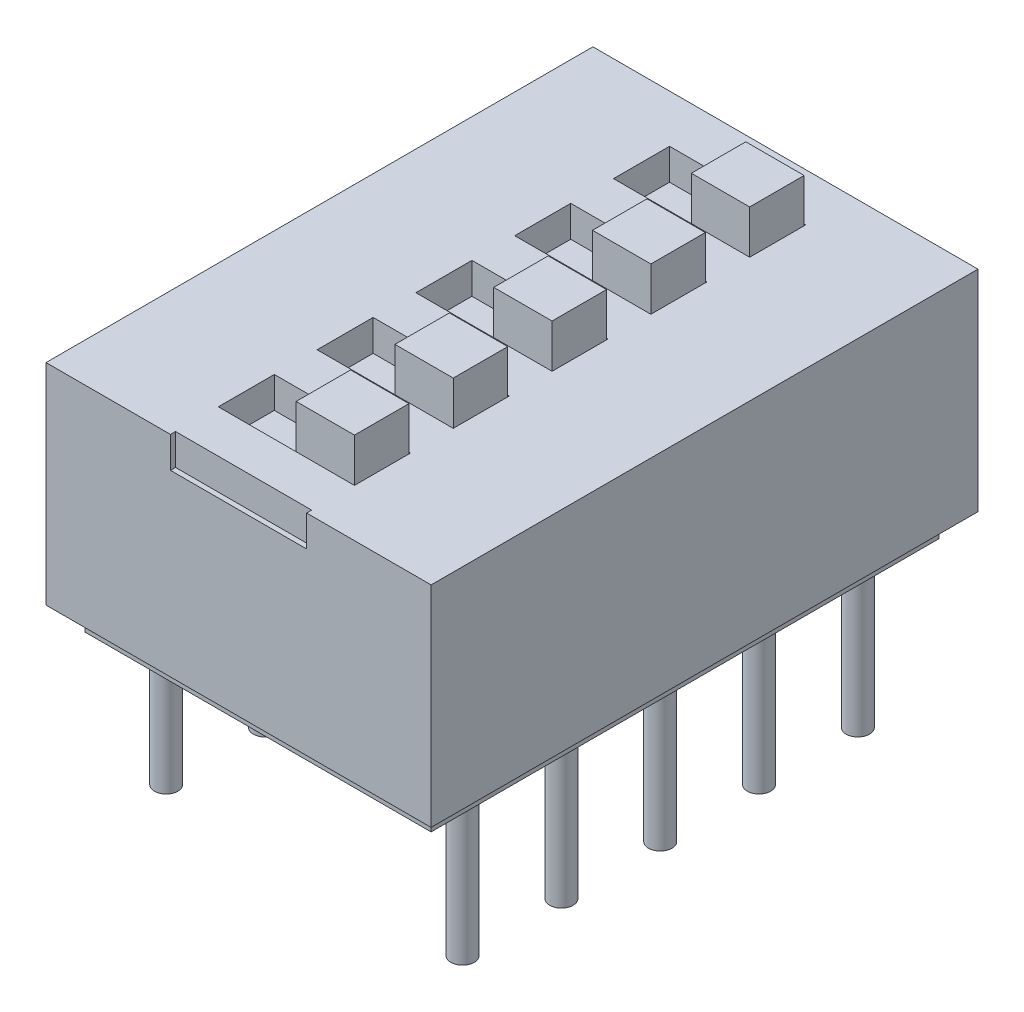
ISO-10303-21;
HEADER;
FILE_DESCRIPTION(('STEP AP214'),'2;1');
FILE_NAME('part.step','',(''),(''),'','','');
FILE_SCHEMA(('AUTOMOTIVE_DESIGN { 1 0 10303 214 1 1 1 1 }'));
ENDSEC;
DATA;
#1=APPLICATION_CONTEXT('core data for automotive mechanical design processes');
#2=APPLICATION_PROTOCOL_DEFINITION('international standard','automotive_design',2000,#1);
#3=PRODUCT_CONTEXT('',#1,'mechanical');
#4=PRODUCT('Part','Part','',(#3));
#5=PRODUCT_RELATED_PRODUCT_CATEGORY('part','',(#4));
#6=PRODUCT_DEFINITION_FORMATION('','',#4);
#7=PRODUCT_DEFINITION_CONTEXT('part definition',#1,'design');
#8=PRODUCT_DEFINITION('design','',#6,#7);
#9=PRODUCT_DEFINITION_SHAPE('','',#8);
#10=(LENGTH_UNIT() NAMED_UNIT(*) SI_UNIT(.MILLI.,.METRE.));
#11=(NAMED_UNIT(*) PLANE_ANGLE_UNIT() SI_UNIT($,.RADIAN.));
#12=(NAMED_UNIT(*) SI_UNIT($,.STERADIAN.) SOLID_ANGLE_UNIT());
#13=UNCERTAINTY_MEASURE_WITH_UNIT(LENGTH_MEASURE(1.E-05),#10,'distance_accuracy_value','');
#14=(GEOMETRIC_REPRESENTATION_CONTEXT(3) GLOBAL_UNCERTAINTY_ASSIGNED_CONTEXT((#13)) GLOBAL_UNIT_ASSIGNED_CONTEXT((#10,
#11,#12)) REPRESENTATION_CONTEXT('',''));
#15=CARTESIAN_POINT('',(0.,0.,0.));
#16=DIRECTION('',(0.,0.,1.));
#17=DIRECTION('',(1.,0.,0.));
#18=AXIS2_PLACEMENT_3D('',#15,#16,#17);
#19=CARTESIAN_POINT('',(-4.45,-0.6,0.5));
#20=DIRECTION('',(0.,-1.,0.));
#21=DIRECTION('',(0.,0.,-1.));
#22=AXIS2_PLACEMENT_3D('',#19,#20,#21);
#23=PLANE('',#22);
#24=CARTESIAN_POINT('',(-3.81000000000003,-0.6,9.56999999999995));
#25=DIRECTION('',(0.,-1.,0.));
#26=DIRECTION('',(0.,0.,-1.));
#27=AXIS2_PLACEMENT_3D('',#24,#25,#26);
#28=CIRCLE('',#27,0.3);
#29=CARTESIAN_POINT('',(-3.81000000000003,-0.6,9.26999999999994));
#30=VERTEX_POINT('',#29);
#31=EDGE_CURVE('E1640',#30,#30,#28,.T.);
#32=ORIENTED_EDGE('',*,*,#31,.F.);
#33=EDGE_LOOP('',(#32));
#34=FACE_BOUND('',#33,.T.);
#35=CARTESIAN_POINT('',(-3.81000000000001,-0.6,4.48999999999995));
#36=DIRECTION('',(0.,-1.,0.));
#37=DIRECTION('',(0.,0.,-1.));
#38=AXIS2_PLACEMENT_3D('',#35,#36,#37);
#39=CIRCLE('',#38,0.3);
#40=CARTESIAN_POINT('',(-3.81000000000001,-0.6,4.18999999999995));
#41=VERTEX_POINT('',#40);
#42=EDGE_CURVE('E1655',#41,#41,#39,.T.);
#43=ORIENTED_EDGE('',*,*,#42,.F.);
#44=EDGE_LOOP('',(#43));
#45=FACE_BOUND('',#44,.T.);
#46=CARTESIAN_POINT('',(3.80999999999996,-0.6,12.11));
#47=DIRECTION('',(0.,-1.,0.));
#48=DIRECTION('',(0.,0.,-1.));
#49=AXIS2_PLACEMENT_3D('',#46,#47,#48);
#50=CIRCLE('',#49,0.300000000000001);
#51=CARTESIAN_POINT('',(3.80999999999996,-0.6,11.81));
#52=VERTEX_POINT('',#51);
#53=EDGE_CURVE('E1667',#52,#52,#50,.T.);
#54=ORIENTED_EDGE('',*,*,#53,.F.);
#55=EDGE_LOOP('',(#54));
#56=FACE_BOUND('',#55,.T.);
#57=CARTESIAN_POINT('',(3.80999999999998,-0.6,7.03));
#58=DIRECTION('',(0.,-1.,0.));
#59=DIRECTION('',(0.,0.,-1.));
#60=AXIS2_PLACEMENT_3D('',#57,#58,#59);
#61=CIRCLE('',#60,0.3);
#62=CARTESIAN_POINT('',(3.80999999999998,-0.6,6.73));
#63=VERTEX_POINT('',#62);
#64=EDGE_CURVE('E1679',#63,#63,#61,.T.);
#65=ORIENTED_EDGE('',*,*,#64,.F.);
#66=EDGE_LOOP('',(#65));
#67=FACE_BOUND('',#66,.T.);
#68=CARTESIAN_POINT('',(3.81,-0.6,1.95));
#69=DIRECTION('',(0.,-1.,0.));
#70=DIRECTION('',(0.,0.,-1.));
#71=AXIS2_PLACEMENT_3D('',#68,#69,#70);
#72=CIRCLE('',#71,0.3);
#73=CARTESIAN_POINT('',(3.81,-0.6,1.65));
#74=VERTEX_POINT('',#73);
#75=EDGE_CURVE('E1691',#74,#74,#72,.T.);
#76=ORIENTED_EDGE('',*,*,#75,.F.);
#77=EDGE_LOOP('',(#76));
#78=FACE_BOUND('',#77,.T.);
#79=DIRECTION('',(0.,0.,-1.));
#80=VECTOR('',#79,1.);
#81=CARTESIAN_POINT('',(-4.45,-0.6,13.56));
#82=LINE('',#81,#80);
#83=CARTESIAN_POINT('',(-4.45,-0.6,13.56));
#84=VERTEX_POINT('',#83);
#85=CARTESIAN_POINT('',(-4.45,-0.6,0.5));
#86=VERTEX_POINT('',#85);
#87=EDGE_CURVE('E372',#84,#86,#82,.T.);
#88=ORIENTED_EDGE('',*,*,#87,.T.);
#89=DIRECTION('',(1.,0.,0.));
#90=VECTOR('',#89,1.);
#91=CARTESIAN_POINT('',(-4.45,-0.6,0.5));
#92=LINE('',#91,#90);
#93=CARTESIAN_POINT('',(4.45,-0.6,0.5));
#94=VERTEX_POINT('',#93);
#95=EDGE_CURVE('E361',#86,#94,#92,.T.);
#96=ORIENTED_EDGE('',*,*,#95,.T.);
#97=DIRECTION('',(0.,0.,1.));
#98=VECTOR('',#97,1.);
#99=CARTESIAN_POINT('',(4.45,-0.6,13.56));
#100=LINE('',#99,#98);
#101=CARTESIAN_POINT('',(4.45,-0.6,13.56));
#102=VERTEX_POINT('',#101);
#103=EDGE_CURVE('E371',#94,#102,#100,.T.);
#104=ORIENTED_EDGE('',*,*,#103,.T.);
#105=DIRECTION('',(-1.,0.,0.));
#106=VECTOR('',#105,1.);
#107=CARTESIAN_POINT('',(-4.45,-0.6,13.56));
#108=LINE('',#107,#106);
#109=EDGE_CURVE('E377',#102,#84,#108,.T.);
#110=ORIENTED_EDGE('',*,*,#109,.T.);
#111=EDGE_LOOP('',(#88,#96,#104,#110));
#112=FACE_BOUND('',#111,.T.);
#113=CARTESIAN_POINT('',(3.80999999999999,-0.6,4.49));
#114=DIRECTION('',(0.,-1.,0.));
#115=DIRECTION('',(0.,0.,-1.));
#116=AXIS2_PLACEMENT_3D('',#113,#114,#115);
#117=CIRCLE('',#116,0.3);
#118=CARTESIAN_POINT('',(3.80999999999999,-0.6,4.19));
#119=VERTEX_POINT('',#118);
#120=EDGE_CURVE('E1685',#119,#119,#117,.T.);
#121=ORIENTED_EDGE('',*,*,#120,.F.);
#122=EDGE_LOOP('',(#121));
#123=FACE_BOUND('',#122,.T.);
#124=CARTESIAN_POINT('',(3.80999999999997,-0.6,9.57));
#125=DIRECTION('',(0.,-1.,0.));
#126=DIRECTION('',(0.,0.,-1.));
#127=AXIS2_PLACEMENT_3D('',#124,#125,#126);
#128=CIRCLE('',#127,0.3);
#129=CARTESIAN_POINT('',(3.80999999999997,-0.6,9.27));
#130=VERTEX_POINT('',#129);
#131=EDGE_CURVE('E1673',#130,#130,#128,.T.);
#132=ORIENTED_EDGE('',*,*,#131,.F.);
#133=EDGE_LOOP('',(#132));
#134=FACE_BOUND('',#133,.T.);
#135=CARTESIAN_POINT('',(-3.81,-0.6,1.94999999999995));
#136=DIRECTION('',(0.,-1.,0.));
#137=DIRECTION('',(0.,0.,-1.));
#138=AXIS2_PLACEMENT_3D('',#135,#136,#137);
#139=CIRCLE('',#138,0.3);
#140=CARTESIAN_POINT('',(-3.81,-0.6,1.64999999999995));
#141=VERTEX_POINT('',#140);
#142=EDGE_CURVE('E1661',#141,#141,#139,.T.);
#143=ORIENTED_EDGE('',*,*,#142,.F.);
#144=EDGE_LOOP('',(#143));
#145=FACE_BOUND('',#144,.T.);
#146=CARTESIAN_POINT('',(-3.81000000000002,-0.6,7.02999999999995));
#147=DIRECTION('',(0.,-1.,0.));
#148=DIRECTION('',(0.,0.,-1.));
#149=AXIS2_PLACEMENT_3D('',#146,#147,#148);
#150=CIRCLE('',#149,0.3);
#151=CARTESIAN_POINT('',(-3.81000000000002,-0.6,6.72999999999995));
#152=VERTEX_POINT('',#151);
#153=EDGE_CURVE('E1650',#152,#152,#150,.T.);
#154=ORIENTED_EDGE('',*,*,#153,.F.);
#155=EDGE_LOOP('',(#154));
#156=FACE_BOUND('',#155,.T.);
#157=CARTESIAN_POINT('',(-3.81000000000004,-0.6,12.1099999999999));
#158=DIRECTION('',(0.,-1.,0.));
#159=DIRECTION('',(0.,0.,-1.));
#160=AXIS2_PLACEMENT_3D('',#157,#158,#159);
#161=CIRCLE('',#160,0.300000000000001);
#162=CARTESIAN_POINT('',(-3.81000000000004,-0.6,11.8099999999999));
#163=VERTEX_POINT('',#162);
#164=EDGE_CURVE('E1641',#163,#163,#161,.T.);
#165=ORIENTED_EDGE('',*,*,#164,.F.);
#166=EDGE_LOOP('',(#165));
#167=FACE_BOUND('',#166,.T.);
#168=ADVANCED_FACE('F35',(#34,#45,#56,#67,#78,#112,#123,#134,#145,#156,#167),#23,.T.);
#169=CARTESIAN_POINT('',(-4.95,0.,14.06));
#170=DIRECTION('',(0.,1.,0.));
#171=DIRECTION('',(0.,0.,1.));
#172=AXIS2_PLACEMENT_3D('',#169,#170,#171);
#173=PLANE('',#172);
#174=DIRECTION('',(1.,0.,0.));
#175=VECTOR('',#174,1.);
#176=CARTESIAN_POINT('',(-4.95,0.,0.));
#177=LINE('',#176,#175);
#178=CARTESIAN_POINT('',(-4.95,0.,0.));
#179=VERTEX_POINT('',#178);
#180=CARTESIAN_POINT('',(4.95,0.,0.));
#181=VERTEX_POINT('',#180);
#182=EDGE_CURVE('E730',#179,#181,#177,.T.);
#183=ORIENTED_EDGE('',*,*,#182,.T.);
#184=DIRECTION('',(0.,0.,-1.));
#185=VECTOR('',#184,1.);
#186=CARTESIAN_POINT('',(4.95,0.,14.06));
#187=LINE('',#186,#185);
#188=CARTESIAN_POINT('',(4.95,0.,14.06));
#189=VERTEX_POINT('',#188);
#190=EDGE_CURVE('E740',#189,#181,#187,.T.);
#191=ORIENTED_EDGE('',*,*,#190,.F.);
#192=DIRECTION('',(1.,0.,0.));
#193=VECTOR('',#192,1.);
#194=CARTESIAN_POINT('',(-4.95,0.,14.06));
#195=LINE('',#194,#193);
#196=CARTESIAN_POINT('',(-4.95,0.,14.06));
#197=VERTEX_POINT('',#196);
#198=EDGE_CURVE('E718',#197,#189,#195,.T.);
#199=ORIENTED_EDGE('',*,*,#198,.F.);
#200=DIRECTION('',(0.,0.,-1.));
#201=VECTOR('',#200,1.);
#202=CARTESIAN_POINT('',(-4.95,0.,14.06));
#203=LINE('',#202,#201);
#204=EDGE_CURVE('E743',#197,#179,#203,.T.);
#205=ORIENTED_EDGE('',*,*,#204,.T.);
#206=EDGE_LOOP('',(#183,#191,#199,#205));
#207=FACE_BOUND('',#206,.T.);
#208=DIRECTION('',(0.,0.,-1.));
#209=VECTOR('',#208,1.);
#210=CARTESIAN_POINT('',(-4.45,0.,13.56));
#211=LINE('',#210,#209);
#212=CARTESIAN_POINT('',(-4.45,0.,13.56));
#213=VERTEX_POINT('',#212);
#214=CARTESIAN_POINT('',(-4.45,0.,0.5));
#215=VERTEX_POINT('',#214);
#216=EDGE_CURVE('E384',#213,#215,#211,.T.);
#217=ORIENTED_EDGE('',*,*,#216,.F.);
#218=DIRECTION('',(-1.,0.,0.));
#219=VECTOR('',#218,1.);
#220=CARTESIAN_POINT('',(-4.45,0.,13.56));
#221=LINE('',#220,#219);
#222=CARTESIAN_POINT('',(4.45,0.,13.56));
#223=VERTEX_POINT('',#222);
#224=EDGE_CURVE('E381',#223,#213,#221,.T.);
#225=ORIENTED_EDGE('',*,*,#224,.F.);
#226=DIRECTION('',(0.,0.,1.));
#227=VECTOR('',#226,1.);
#228=CARTESIAN_POINT('',(4.45,0.,13.56));
#229=LINE('',#228,#227);
#230=CARTESIAN_POINT('',(4.45,0.,0.5));
#231=VERTEX_POINT('',#230);
#232=EDGE_CURVE('E55',#231,#223,#229,.T.);
#233=ORIENTED_EDGE('',*,*,#232,.F.);
#234=DIRECTION('',(1.,0.,0.));
#235=VECTOR('',#234,1.);
#236=CARTESIAN_POINT('',(-4.45,0.,0.5));
#237=LINE('',#236,#235);
#238=EDGE_CURVE('E50',#215,#231,#237,.T.);
#239=ORIENTED_EDGE('',*,*,#238,.F.);
#240=EDGE_LOOP('',(#217,#225,#233,#239));
#241=FACE_BOUND('',#240,.T.);
#242=ADVANCED_FACE('F798',(#207,#241),#173,.F.);
#243=CARTESIAN_POINT('',(-1.74999999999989,4.6,12.83));
#244=DIRECTION('',(0.,1.,0.));
#245=DIRECTION('',(0.,0.,1.));
#246=AXIS2_PLACEMENT_3D('',#243,#244,#245);
#247=PLANE('',#246);
#248=DIRECTION('',(0.,0.,1.));
#249=VECTOR('',#248,1.);
#250=CARTESIAN_POINT('',(-1.74999999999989,4.6,11.39));
#251=LINE('',#250,#249);
#252=CARTESIAN_POINT('',(-1.74999999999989,4.6,11.39));
#253=VERTEX_POINT('',#252);
#254=CARTESIAN_POINT('',(-1.74999999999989,4.6,12.83));
#255=VERTEX_POINT('',#254);
#256=EDGE_CURVE('E536',#253,#255,#251,.T.);
#257=ORIENTED_EDGE('',*,*,#256,.T.);
#258=DIRECTION('',(1.,0.,0.));
#259=VECTOR('',#258,1.);
#260=CARTESIAN_POINT('',(-1.74999999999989,4.6,12.83));
#261=LINE('',#260,#259);
#262=CARTESIAN_POINT('',(1.75000000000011,4.6,12.83));
#263=VERTEX_POINT('',#262);
#264=EDGE_CURVE('E539',#255,#263,#261,.T.);
#265=ORIENTED_EDGE('',*,*,#264,.T.);
#266=DIRECTION('',(0.,0.,-1.));
#267=VECTOR('',#266,1.);
#268=CARTESIAN_POINT('',(1.75000000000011,4.6,11.39));
#269=LINE('',#268,#267);
#270=CARTESIAN_POINT('',(1.75000000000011,4.6,11.39));
#271=VERTEX_POINT('',#270);
#272=EDGE_CURVE('E543',#263,#271,#269,.T.);
#273=ORIENTED_EDGE('',*,*,#272,.T.);
#274=DIRECTION('',(-1.,0.,0.));
#275=VECTOR('',#274,1.);
#276=CARTESIAN_POINT('',(-1.74999999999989,4.6,11.39));
#277=LINE('',#276,#275);
#278=EDGE_CURVE('E546',#271,#253,#277,.T.);
#279=ORIENTED_EDGE('',*,*,#278,.T.);
#280=EDGE_LOOP('',(#257,#265,#273,#279));
#281=FACE_BOUND('',#280,.T.);
#282=DIRECTION('',(0.,0.,1.));
#283=VECTOR('',#282,1.);
#284=CARTESIAN_POINT('',(0.230000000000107,4.6,11.41));
#285=LINE('',#284,#283);
#286=CARTESIAN_POINT('',(0.230000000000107,4.6,11.41));
#287=VERTEX_POINT('',#286);
#288=CARTESIAN_POINT('',(0.230000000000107,4.6,12.81));
#289=VERTEX_POINT('',#288);
#290=EDGE_CURVE('E388',#287,#289,#285,.T.);
#291=ORIENTED_EDGE('',*,*,#290,.F.);
#292=DIRECTION('',(-1.,0.,0.));
#293=VECTOR('',#292,1.);
#294=CARTESIAN_POINT('',(0.230000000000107,4.6,11.41));
#295=LINE('',#294,#293);
#296=CARTESIAN_POINT('',(1.73000000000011,4.6,11.41));
#297=VERTEX_POINT('',#296);
#298=EDGE_CURVE('E385',#297,#287,#295,.T.);
#299=ORIENTED_EDGE('',*,*,#298,.F.);
#300=DIRECTION('',(0.,0.,-1.));
#301=VECTOR('',#300,1.);
#302=CARTESIAN_POINT('',(1.73000000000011,4.6,11.41));
#303=LINE('',#302,#301);
#304=CARTESIAN_POINT('',(1.73000000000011,4.6,12.81));
#305=VERTEX_POINT('',#304);
#306=EDGE_CURVE('E398',#305,#297,#303,.T.);
#307=ORIENTED_EDGE('',*,*,#306,.F.);
#308=DIRECTION('',(1.,0.,0.));
#309=VECTOR('',#308,1.);
#310=CARTESIAN_POINT('',(0.230000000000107,4.6,12.81));
#311=LINE('',#310,#309);
#312=EDGE_CURVE('E406',#289,#305,#311,.T.);
#313=ORIENTED_EDGE('',*,*,#312,.F.);
#314=EDGE_LOOP('',(#291,#299,#307,#313));
#315=FACE_BOUND('',#314,.T.);
#316=ADVANCED_FACE('F804',(#281,#315),#247,.T.);
#317=CARTESIAN_POINT('',(-1.74999999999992,4.6,10.29));
#318=DIRECTION('',(0.,1.,0.));
#319=DIRECTION('',(0.,0.,1.));
#320=AXIS2_PLACEMENT_3D('',#317,#318,#319);
#321=PLANE('',#320);
#322=DIRECTION('',(0.,0.,1.));
#323=VECTOR('',#322,1.);
#324=CARTESIAN_POINT('',(-1.74999999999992,4.6,8.85));
#325=LINE('',#324,#323);
#326=CARTESIAN_POINT('',(-1.74999999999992,4.6,8.85));
#327=VERTEX_POINT('',#326);
#328=CARTESIAN_POINT('',(-1.74999999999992,4.6,10.29));
#329=VERTEX_POINT('',#328);
#330=EDGE_CURVE('E568',#327,#329,#325,.T.);
#331=ORIENTED_EDGE('',*,*,#330,.T.);
#332=DIRECTION('',(1.,0.,0.));
#333=VECTOR('',#332,1.);
#334=CARTESIAN_POINT('',(-1.74999999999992,4.6,10.29));
#335=LINE('',#334,#333);
#336=CARTESIAN_POINT('',(1.75000000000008,4.6,10.29));
#337=VERTEX_POINT('',#336);
#338=EDGE_CURVE('E571',#329,#337,#335,.T.);
#339=ORIENTED_EDGE('',*,*,#338,.T.);
#340=DIRECTION('',(0.,0.,-1.));
#341=VECTOR('',#340,1.);
#342=CARTESIAN_POINT('',(1.75000000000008,4.6,8.85));
#343=LINE('',#342,#341);
#344=CARTESIAN_POINT('',(1.75000000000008,4.6,8.85));
#345=VERTEX_POINT('',#344);
#346=EDGE_CURVE('E575',#337,#345,#343,.T.);
#347=ORIENTED_EDGE('',*,*,#346,.T.);
#348=DIRECTION('',(-1.,0.,0.));
#349=VECTOR('',#348,1.);
#350=CARTESIAN_POINT('',(-1.74999999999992,4.6,8.85));
#351=LINE('',#350,#349);
#352=EDGE_CURVE('E578',#345,#327,#351,.T.);
#353=ORIENTED_EDGE('',*,*,#352,.T.);
#354=EDGE_LOOP('',(#331,#339,#347,#353));
#355=FACE_BOUND('',#354,.T.);
#356=DIRECTION('',(0.,0.,1.));
#357=VECTOR('',#356,1.);
#358=CARTESIAN_POINT('',(0.230000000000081,4.6,8.87));
#359=LINE('',#358,#357);
#360=CARTESIAN_POINT('',(0.230000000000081,4.6,8.87));
#361=VERTEX_POINT('',#360);
#362=CARTESIAN_POINT('',(0.230000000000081,4.6,10.27));
#363=VERTEX_POINT('',#362);
#364=EDGE_CURVE('E433',#361,#363,#359,.T.);
#365=ORIENTED_EDGE('',*,*,#364,.F.);
#366=DIRECTION('',(-1.,0.,0.));
#367=VECTOR('',#366,1.);
#368=CARTESIAN_POINT('',(0.230000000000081,4.6,8.87));
#369=LINE('',#368,#367);
#370=CARTESIAN_POINT('',(1.73000000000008,4.6,8.87));
#371=VERTEX_POINT('',#370);
#372=EDGE_CURVE('E419',#371,#361,#369,.T.);
#373=ORIENTED_EDGE('',*,*,#372,.F.);
#374=DIRECTION('',(0.,0.,-1.));
#375=VECTOR('',#374,1.);
#376=CARTESIAN_POINT('',(1.73000000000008,4.6,8.87));
#377=LINE('',#376,#375);
#378=CARTESIAN_POINT('',(1.73000000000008,4.6,10.27));
#379=VERTEX_POINT('',#378);
#380=EDGE_CURVE('E424',#379,#371,#377,.T.);
#381=ORIENTED_EDGE('',*,*,#380,.F.);
#382=DIRECTION('',(1.,0.,0.));
#383=VECTOR('',#382,1.);
#384=CARTESIAN_POINT('',(0.230000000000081,4.6,10.27));
#385=LINE('',#384,#383);
#386=EDGE_CURVE('E435',#363,#379,#385,.T.);
#387=ORIENTED_EDGE('',*,*,#386,.F.);
#388=EDGE_LOOP('',(#365,#373,#381,#387));
#389=FACE_BOUND('',#388,.T.);
#390=ADVANCED_FACE('F927',(#355,#389),#321,.T.);
#391=CARTESIAN_POINT('',(-1.74999999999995,4.6,7.75));
#392=DIRECTION('',(0.,1.,0.));
#393=DIRECTION('',(0.,0.,1.));
#394=AXIS2_PLACEMENT_3D('',#391,#392,#393);
#395=PLANE('',#394);
#396=DIRECTION('',(0.,0.,1.));
#397=VECTOR('',#396,1.);
#398=CARTESIAN_POINT('',(-1.74999999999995,4.6,6.31));
#399=LINE('',#398,#397);
#400=CARTESIAN_POINT('',(-1.74999999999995,4.6,6.31));
#401=VERTEX_POINT('',#400);
#402=CARTESIAN_POINT('',(-1.74999999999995,4.6,7.75));
#403=VERTEX_POINT('',#402);
#404=EDGE_CURVE('E600',#401,#403,#399,.T.);
#405=ORIENTED_EDGE('',*,*,#404,.T.);
#406=DIRECTION('',(1.,0.,0.));
#407=VECTOR('',#406,1.);
#408=CARTESIAN_POINT('',(-1.74999999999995,4.6,7.75));
#409=LINE('',#408,#407);
#410=CARTESIAN_POINT('',(1.75000000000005,4.6,7.75));
#411=VERTEX_POINT('',#410);
#412=EDGE_CURVE('E603',#403,#411,#409,.T.);
#413=ORIENTED_EDGE('',*,*,#412,.T.);
#414=DIRECTION('',(0.,0.,-1.));
#415=VECTOR('',#414,1.);
#416=CARTESIAN_POINT('',(1.75000000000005,4.6,6.31));
#417=LINE('',#416,#415);
#418=CARTESIAN_POINT('',(1.75000000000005,4.6,6.31));
#419=VERTEX_POINT('',#418);
#420=EDGE_CURVE('E607',#411,#419,#417,.T.);
#421=ORIENTED_EDGE('',*,*,#420,.T.);
#422=DIRECTION('',(-1.,0.,0.));
#423=VECTOR('',#422,1.);
#424=CARTESIAN_POINT('',(-1.74999999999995,4.6,6.31));
#425=LINE('',#424,#423);
#426=EDGE_CURVE('E610',#419,#401,#425,.T.);
#427=ORIENTED_EDGE('',*,*,#426,.T.);
#428=EDGE_LOOP('',(#405,#413,#421,#427));
#429=FACE_BOUND('',#428,.T.);
#430=DIRECTION('',(0.,0.,1.));
#431=VECTOR('',#430,1.);
#432=CARTESIAN_POINT('',(0.230000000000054,4.6,6.33));
#433=LINE('',#432,#431);
#434=CARTESIAN_POINT('',(0.230000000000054,4.6,6.33));
#435=VERTEX_POINT('',#434);
#436=CARTESIAN_POINT('',(0.230000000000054,4.6,7.73));
#437=VERTEX_POINT('',#436);
#438=EDGE_CURVE('E462',#435,#437,#433,.T.);
#439=ORIENTED_EDGE('',*,*,#438,.F.);
#440=DIRECTION('',(-1.,0.,0.));
#441=VECTOR('',#440,1.);
#442=CARTESIAN_POINT('',(0.230000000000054,4.6,6.33));
#443=LINE('',#442,#441);
#444=CARTESIAN_POINT('',(1.73000000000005,4.6,6.33));
#445=VERTEX_POINT('',#444);
#446=EDGE_CURVE('E448',#445,#435,#443,.T.);
#447=ORIENTED_EDGE('',*,*,#446,.F.);
#448=DIRECTION('',(0.,0.,-1.));
#449=VECTOR('',#448,1.);
#450=CARTESIAN_POINT('',(1.73000000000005,4.6,6.33));
#451=LINE('',#450,#449);
#452=CARTESIAN_POINT('',(1.73000000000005,4.6,7.73));
#453=VERTEX_POINT('',#452);
#454=EDGE_CURVE('E453',#453,#445,#451,.T.);
#455=ORIENTED_EDGE('',*,*,#454,.F.);
#456=DIRECTION('',(1.,0.,0.));
#457=VECTOR('',#456,1.);
#458=CARTESIAN_POINT('',(0.230000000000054,4.6,7.73));
#459=LINE('',#458,#457);
#460=EDGE_CURVE('E464',#437,#453,#459,.T.);
#461=ORIENTED_EDGE('',*,*,#460,.F.);
#462=EDGE_LOOP('',(#439,#447,#455,#461));
#463=FACE_BOUND('',#462,.T.);
#464=ADVANCED_FACE('F947',(#429,#463),#395,.T.);
#465=CARTESIAN_POINT('',(-1.74999999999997,4.6,5.21));
#466=DIRECTION('',(0.,1.,0.));
#467=DIRECTION('',(0.,0.,1.));
#468=AXIS2_PLACEMENT_3D('',#465,#466,#467);
#469=PLANE('',#468);
#470=DIRECTION('',(0.,0.,1.));
#471=VECTOR('',#470,1.);
#472=CARTESIAN_POINT('',(-1.74999999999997,4.6,3.77));
#473=LINE('',#472,#471);
#474=CARTESIAN_POINT('',(-1.74999999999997,4.6,3.77));
#475=VERTEX_POINT('',#474);
#476=CARTESIAN_POINT('',(-1.74999999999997,4.6,5.21));
#477=VERTEX_POINT('',#476);
#478=EDGE_CURVE('E632',#475,#477,#473,.T.);
#479=ORIENTED_EDGE('',*,*,#478,.T.);
#480=DIRECTION('',(1.,0.,0.));
#481=VECTOR('',#480,1.);
#482=CARTESIAN_POINT('',(-1.74999999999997,4.6,5.21));
#483=LINE('',#482,#481);
#484=CARTESIAN_POINT('',(1.75000000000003,4.6,5.21));
#485=VERTEX_POINT('',#484);
#486=EDGE_CURVE('E635',#477,#485,#483,.T.);
#487=ORIENTED_EDGE('',*,*,#486,.T.);
#488=DIRECTION('',(0.,0.,-1.));
#489=VECTOR('',#488,1.);
#490=CARTESIAN_POINT('',(1.75000000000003,4.6,3.77));
#491=LINE('',#490,#489);
#492=CARTESIAN_POINT('',(1.75000000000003,4.6,3.77));
#493=VERTEX_POINT('',#492);
#494=EDGE_CURVE('E639',#485,#493,#491,.T.);
#495=ORIENTED_EDGE('',*,*,#494,.T.);
#496=DIRECTION('',(-1.,0.,0.));
#497=VECTOR('',#496,1.);
#498=CARTESIAN_POINT('',(-1.74999999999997,4.6,3.77));
#499=LINE('',#498,#497);
#500=EDGE_CURVE('E642',#493,#475,#499,.T.);
#501=ORIENTED_EDGE('',*,*,#500,.T.);
#502=EDGE_LOOP('',(#479,#487,#495,#501));
#503=FACE_BOUND('',#502,.T.);
#504=DIRECTION('',(0.,0.,1.));
#505=VECTOR('',#504,1.);
#506=CARTESIAN_POINT('',(0.230000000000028,4.6,3.79));
#507=LINE('',#506,#505);
#508=CARTESIAN_POINT('',(0.230000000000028,4.6,3.79));
#509=VERTEX_POINT('',#508);
#510=CARTESIAN_POINT('',(0.230000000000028,4.6,5.19));
#511=VERTEX_POINT('',#510);
#512=EDGE_CURVE('E491',#509,#511,#507,.T.);
#513=ORIENTED_EDGE('',*,*,#512,.F.);
#514=DIRECTION('',(-1.,0.,0.));
#515=VECTOR('',#514,1.);
#516=CARTESIAN_POINT('',(0.230000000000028,4.6,3.79));
#517=LINE('',#516,#515);
#518=CARTESIAN_POINT('',(1.73000000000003,4.6,3.79));
#519=VERTEX_POINT('',#518);
#520=EDGE_CURVE('E477',#519,#509,#517,.T.);
#521=ORIENTED_EDGE('',*,*,#520,.F.);
#522=DIRECTION('',(0.,0.,-1.));
#523=VECTOR('',#522,1.);
#524=CARTESIAN_POINT('',(1.73000000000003,4.6,3.79));
#525=LINE('',#524,#523);
#526=CARTESIAN_POINT('',(1.73000000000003,4.6,5.19));
#527=VERTEX_POINT('',#526);
#528=EDGE_CURVE('E482',#527,#519,#525,.T.);
#529=ORIENTED_EDGE('',*,*,#528,.F.);
#530=DIRECTION('',(1.,0.,0.));
#531=VECTOR('',#530,1.);
#532=CARTESIAN_POINT('',(0.230000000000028,4.6,5.19));
#533=LINE('',#532,#531);
#534=EDGE_CURVE('E493',#511,#527,#533,.T.);
#535=ORIENTED_EDGE('',*,*,#534,.F.);
#536=EDGE_LOOP('',(#513,#521,#529,#535));
#537=FACE_BOUND('',#536,.T.);
#538=ADVANCED_FACE('F967',(#503,#537),#469,.T.);
#539=CARTESIAN_POINT('',(-1.75,4.6,2.67));
#540=DIRECTION('',(0.,1.,0.));
#541=DIRECTION('',(0.,0.,1.));
#542=AXIS2_PLACEMENT_3D('',#539,#540,#541);
#543=PLANE('',#542);
#544=DIRECTION('',(0.,0.,1.));
#545=VECTOR('',#544,1.);
#546=CARTESIAN_POINT('',(-1.75,4.6,1.23));
#547=LINE('',#546,#545);
#548=CARTESIAN_POINT('',(-1.75,4.6,1.23));
#549=VERTEX_POINT('',#548);
#550=CARTESIAN_POINT('',(-1.75,4.6,2.67));
#551=VERTEX_POINT('',#550);
#552=EDGE_CURVE('E683',#549,#551,#547,.T.);
#553=ORIENTED_EDGE('',*,*,#552,.T.);
#554=DIRECTION('',(1.,0.,0.));
#555=VECTOR('',#554,1.);
#556=CARTESIAN_POINT('',(-1.75,4.6,2.67));
#557=LINE('',#556,#555);
#558=CARTESIAN_POINT('',(1.75,4.6,2.67));
#559=VERTEX_POINT('',#558);
#560=EDGE_CURVE('E686',#551,#559,#557,.T.);
#561=ORIENTED_EDGE('',*,*,#560,.T.);
#562=DIRECTION('',(0.,0.,-1.));
#563=VECTOR('',#562,1.);
#564=CARTESIAN_POINT('',(1.75,4.6,1.23));
#565=LINE('',#564,#563);
#566=CARTESIAN_POINT('',(1.75,4.6,1.23));
#567=VERTEX_POINT('',#566);
#568=EDGE_CURVE('E690',#559,#567,#565,.T.);
#569=ORIENTED_EDGE('',*,*,#568,.T.);
#570=DIRECTION('',(-1.,0.,0.));
#571=VECTOR('',#570,1.);
#572=CARTESIAN_POINT('',(-1.75,4.6,1.23));
#573=LINE('',#572,#571);
#574=EDGE_CURVE('E693',#567,#549,#573,.T.);
#575=ORIENTED_EDGE('',*,*,#574,.T.);
#576=EDGE_LOOP('',(#553,#561,#569,#575));
#577=FACE_BOUND('',#576,.T.);
#578=DIRECTION('',(1.,0.,0.));
#579=VECTOR('',#578,1.);
#580=CARTESIAN_POINT('',(0.230000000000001,4.6,2.65));
#581=LINE('',#580,#579);
#582=CARTESIAN_POINT('',(0.230000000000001,4.6,2.65));
#583=VERTEX_POINT('',#582);
#584=CARTESIAN_POINT('',(1.73,4.6,2.65));
#585=VERTEX_POINT('',#584);
#586=EDGE_CURVE('E520',#583,#585,#581,.T.);
#587=ORIENTED_EDGE('',*,*,#586,.F.);
#588=DIRECTION('',(0.,0.,1.));
#589=VECTOR('',#588,1.);
#590=CARTESIAN_POINT('',(0.230000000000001,4.6,1.25));
#591=LINE('',#590,#589);
#592=CARTESIAN_POINT('',(0.230000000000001,4.6,1.25));
#593=VERTEX_POINT('',#592);
#594=EDGE_CURVE('E506',#593,#583,#591,.T.);
#595=ORIENTED_EDGE('',*,*,#594,.F.);
#596=DIRECTION('',(-1.,0.,0.));
#597=VECTOR('',#596,1.);
#598=CARTESIAN_POINT('',(0.230000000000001,4.6,1.25));
#599=LINE('',#598,#597);
#600=CARTESIAN_POINT('',(1.73,4.6,1.25));
#601=VERTEX_POINT('',#600);
#602=EDGE_CURVE('E511',#601,#593,#599,.T.);
#603=ORIENTED_EDGE('',*,*,#602,.F.);
#604=DIRECTION('',(0.,0.,-1.));
#605=VECTOR('',#604,1.);
#606=CARTESIAN_POINT('',(1.73,4.6,1.25));
#607=LINE('',#606,#605);
#608=EDGE_CURVE('E522',#585,#601,#607,.T.);
#609=ORIENTED_EDGE('',*,*,#608,.F.);
#610=EDGE_LOOP('',(#587,#595,#603,#609));
#611=FACE_BOUND('',#610,.T.);
#612=ADVANCED_FACE('F987',(#577,#611),#543,.T.);
#613=CARTESIAN_POINT('',(-4.95,5.4,14.06));
#614=DIRECTION('',(1.,0.,0.));
#615=DIRECTION('',(0.,1.,0.));
#616=AXIS2_PLACEMENT_3D('',#613,#614,#615);
#617=PLANE('',#616);
#618=DIRECTION('',(0.,-1.,0.));
#619=VECTOR('',#618,1.);
#620=CARTESIAN_POINT('',(-4.95,5.4,0.));
#621=LINE('',#620,#619);
#622=CARTESIAN_POINT('',(-4.95,5.4,0.));
#623=VERTEX_POINT('',#622);
#624=EDGE_CURVE('E708',#623,#179,#621,.T.);
#625=ORIENTED_EDGE('',*,*,#624,.T.);
#626=ORIENTED_EDGE('',*,*,#204,.F.);
#627=DIRECTION('',(0.,-1.,0.));
#628=VECTOR('',#627,1.);
#629=CARTESIAN_POINT('',(-4.95,5.4,14.06));
#630=LINE('',#629,#628);
#631=CARTESIAN_POINT('',(-4.95,5.4,14.06));
#632=VERTEX_POINT('',#631);
#633=EDGE_CURVE('E715',#632,#197,#630,.T.);
#634=ORIENTED_EDGE('',*,*,#633,.F.);
#635=DIRECTION('',(0.,0.,-1.));
#636=VECTOR('',#635,1.);
#637=CARTESIAN_POINT('',(-4.95,5.4,14.06));
#638=LINE('',#637,#636);
#639=EDGE_CURVE('E727',#632,#623,#638,.T.);
#640=ORIENTED_EDGE('',*,*,#639,.T.);
#641=EDGE_LOOP('',(#625,#626,#634,#640));
#642=FACE_BOUND('',#641,.T.);
#643=ADVANCED_FACE('F37',(#642),#617,.F.);
#644=CARTESIAN_POINT('',(4.95,5.4,14.06));
#645=DIRECTION('',(-1.,0.,0.));
#646=DIRECTION('',(0.,-1.,0.));
#647=AXIS2_PLACEMENT_3D('',#644,#645,#646);
#648=PLANE('',#647);
#649=DIRECTION('',(0.,1.,0.));
#650=VECTOR('',#649,1.);
#651=CARTESIAN_POINT('',(4.95,5.4,0.));
#652=LINE('',#651,#650);
#653=CARTESIAN_POINT('',(4.95,5.4,0.));
#654=VERTEX_POINT('',#653);
#655=EDGE_CURVE('E732',#181,#654,#652,.T.);
#656=ORIENTED_EDGE('',*,*,#655,.T.);
#657=DIRECTION('',(0.,0.,-1.));
#658=VECTOR('',#657,1.);
#659=CARTESIAN_POINT('',(4.95,5.4,14.06));
#660=LINE('',#659,#658);
#661=CARTESIAN_POINT('',(4.95,5.4,14.06));
#662=VERTEX_POINT('',#661);
#663=EDGE_CURVE('E737',#662,#654,#660,.T.);
#664=ORIENTED_EDGE('',*,*,#663,.F.);
#665=DIRECTION('',(0.,1.,0.));
#666=VECTOR('',#665,1.);
#667=CARTESIAN_POINT('',(4.95,5.4,14.06));
#668=LINE('',#667,#666);
#669=EDGE_CURVE('E721',#189,#662,#668,.T.);
#670=ORIENTED_EDGE('',*,*,#669,.F.);
#671=ORIENTED_EDGE('',*,*,#190,.T.);
#672=EDGE_LOOP('',(#656,#664,#670,#671));
#673=FACE_BOUND('',#672,.T.);
#674=ADVANCED_FACE('F767',(#673),#648,.F.);
#675=CARTESIAN_POINT('',(-4.95,5.4,14.06));
#676=DIRECTION('',(0.,-1.,0.));
#677=DIRECTION('',(0.,0.,-1.));
#678=AXIS2_PLACEMENT_3D('',#675,#676,#677);
#679=PLANE('',#678);
#680=DIRECTION('',(1.,0.,0.));
#681=VECTOR('',#680,1.);
#682=CARTESIAN_POINT('',(-1.74999999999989,5.4,12.83));
#683=LINE('',#682,#681);
#684=CARTESIAN_POINT('',(-1.74999999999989,5.4,12.83));
#685=VERTEX_POINT('',#684);
#686=CARTESIAN_POINT('',(1.75000000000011,5.4,12.83));
#687=VERTEX_POINT('',#686);
#688=EDGE_CURVE('E551',#685,#687,#683,.T.);
#689=ORIENTED_EDGE('',*,*,#688,.F.);
#690=DIRECTION('',(0.,0.,1.));
#691=VECTOR('',#690,1.);
#692=CARTESIAN_POINT('',(-1.74999999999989,5.4,11.39));
#693=LINE('',#692,#691);
#694=CARTESIAN_POINT('',(-1.74999999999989,5.4,11.39));
#695=VERTEX_POINT('',#694);
#696=EDGE_CURVE('E535',#695,#685,#693,.T.);
#697=ORIENTED_EDGE('',*,*,#696,.F.);
#698=DIRECTION('',(-1.,0.,0.));
#699=VECTOR('',#698,1.);
#700=CARTESIAN_POINT('',(-1.74999999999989,5.4,11.39));
#701=LINE('',#700,#699);
#702=CARTESIAN_POINT('',(1.75000000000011,5.4,11.39));
#703=VERTEX_POINT('',#702);
#704=EDGE_CURVE('E540',#703,#695,#701,.T.);
#705=ORIENTED_EDGE('',*,*,#704,.F.);
#706=DIRECTION('',(0.,0.,-1.));
#707=VECTOR('',#706,1.);
#708=CARTESIAN_POINT('',(1.75000000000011,5.4,11.39));
#709=LINE('',#708,#707);
#710=EDGE_CURVE('E554',#687,#703,#709,.T.);
#711=ORIENTED_EDGE('',*,*,#710,.F.);
#712=EDGE_LOOP('',(#689,#697,#705,#711));
#713=FACE_BOUND('',#712,.T.);
#714=DIRECTION('',(1.,0.,0.));
#715=VECTOR('',#714,1.);
#716=CARTESIAN_POINT('',(-1.74999999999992,5.4,10.29));
#717=LINE('',#716,#715);
#718=CARTESIAN_POINT('',(-1.74999999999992,5.4,10.29));
#719=VERTEX_POINT('',#718);
#720=CARTESIAN_POINT('',(1.75000000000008,5.4,10.29));
#721=VERTEX_POINT('',#720);
#722=EDGE_CURVE('E583',#719,#721,#717,.T.);
#723=ORIENTED_EDGE('',*,*,#722,.F.);
#724=DIRECTION('',(0.,0.,1.));
#725=VECTOR('',#724,1.);
#726=CARTESIAN_POINT('',(-1.74999999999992,5.4,8.85));
#727=LINE('',#726,#725);
#728=CARTESIAN_POINT('',(-1.74999999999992,5.4,8.85));
#729=VERTEX_POINT('',#728);
#730=EDGE_CURVE('E561',#729,#719,#727,.T.);
#731=ORIENTED_EDGE('',*,*,#730,.F.);
#732=DIRECTION('',(-1.,0.,0.));
#733=VECTOR('',#732,1.);
#734=CARTESIAN_POINT('',(-1.74999999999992,5.4,8.85));
#735=LINE('',#734,#733);
#736=CARTESIAN_POINT('',(1.75000000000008,5.4,8.85));
#737=VERTEX_POINT('',#736);
#738=EDGE_CURVE('E572',#737,#729,#735,.T.);
#739=ORIENTED_EDGE('',*,*,#738,.F.);
#740=DIRECTION('',(0.,0.,-1.));
#741=VECTOR('',#740,1.);
#742=CARTESIAN_POINT('',(1.75000000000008,5.4,8.85));
#743=LINE('',#742,#741);
#744=EDGE_CURVE('E586',#721,#737,#743,.T.);
#745=ORIENTED_EDGE('',*,*,#744,.F.);
#746=EDGE_LOOP('',(#723,#731,#739,#745));
#747=FACE_BOUND('',#746,.T.);
#748=DIRECTION('',(1.,0.,0.));
#749=VECTOR('',#748,1.);
#750=CARTESIAN_POINT('',(-1.74999999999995,5.4,7.75));
#751=LINE('',#750,#749);
#752=CARTESIAN_POINT('',(-1.74999999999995,5.4,7.75));
#753=VERTEX_POINT('',#752);
#754=CARTESIAN_POINT('',(1.75000000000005,5.4,7.75));
#755=VERTEX_POINT('',#754);
#756=EDGE_CURVE('E615',#753,#755,#751,.T.);
#757=ORIENTED_EDGE('',*,*,#756,.F.);
#758=DIRECTION('',(0.,0.,1.));
#759=VECTOR('',#758,1.);
#760=CARTESIAN_POINT('',(-1.74999999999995,5.4,6.31));
#761=LINE('',#760,#759);
#762=CARTESIAN_POINT('',(-1.74999999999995,5.4,6.31));
#763=VERTEX_POINT('',#762);
#764=EDGE_CURVE('E593',#763,#753,#761,.T.);
#765=ORIENTED_EDGE('',*,*,#764,.F.);
#766=DIRECTION('',(-1.,0.,0.));
#767=VECTOR('',#766,1.);
#768=CARTESIAN_POINT('',(-1.74999999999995,5.4,6.31));
#769=LINE('',#768,#767);
#770=CARTESIAN_POINT('',(1.75000000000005,5.4,6.31));
#771=VERTEX_POINT('',#770);
#772=EDGE_CURVE('E604',#771,#763,#769,.T.);
#773=ORIENTED_EDGE('',*,*,#772,.F.);
#774=DIRECTION('',(0.,0.,-1.));
#775=VECTOR('',#774,1.);
#776=CARTESIAN_POINT('',(1.75000000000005,5.4,6.31));
#777=LINE('',#776,#775);
#778=EDGE_CURVE('E618',#755,#771,#777,.T.);
#779=ORIENTED_EDGE('',*,*,#778,.F.);
#780=EDGE_LOOP('',(#757,#765,#773,#779));
#781=FACE_BOUND('',#780,.T.);
#782=DIRECTION('',(1.,0.,0.));
#783=VECTOR('',#782,1.);
#784=CARTESIAN_POINT('',(-1.74999999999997,5.4,5.21));
#785=LINE('',#784,#783);
#786=CARTESIAN_POINT('',(-1.74999999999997,5.4,5.21));
#787=VERTEX_POINT('',#786);
#788=CARTESIAN_POINT('',(1.75000000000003,5.4,5.21));
#789=VERTEX_POINT('',#788);
#790=EDGE_CURVE('E647',#787,#789,#785,.T.);
#791=ORIENTED_EDGE('',*,*,#790,.F.);
#792=DIRECTION('',(0.,0.,1.));
#793=VECTOR('',#792,1.);
#794=CARTESIAN_POINT('',(-1.74999999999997,5.4,3.77));
#795=LINE('',#794,#793);
#796=CARTESIAN_POINT('',(-1.74999999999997,5.4,3.77));
#797=VERTEX_POINT('',#796);
#798=EDGE_CURVE('E625',#797,#787,#795,.T.);
#799=ORIENTED_EDGE('',*,*,#798,.F.);
#800=DIRECTION('',(-1.,0.,0.));
#801=VECTOR('',#800,1.);
#802=CARTESIAN_POINT('',(-1.74999999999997,5.4,3.77));
#803=LINE('',#802,#801);
#804=CARTESIAN_POINT('',(1.75000000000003,5.4,3.77));
#805=VERTEX_POINT('',#804);
#806=EDGE_CURVE('E636',#805,#797,#803,.T.);
#807=ORIENTED_EDGE('',*,*,#806,.F.);
#808=DIRECTION('',(0.,0.,-1.));
#809=VECTOR('',#808,1.);
#810=CARTESIAN_POINT('',(1.75000000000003,5.4,3.77));
#811=LINE('',#810,#809);
#812=EDGE_CURVE('E650',#789,#805,#811,.T.);
#813=ORIENTED_EDGE('',*,*,#812,.F.);
#814=EDGE_LOOP('',(#791,#799,#807,#813));
#815=FACE_BOUND('',#814,.T.);
#816=DIRECTION('',(1.,0.,0.));
#817=VECTOR('',#816,1.);
#818=CARTESIAN_POINT('',(-1.75,5.4,2.67));
#819=LINE('',#818,#817);
#820=CARTESIAN_POINT('',(-1.75,5.4,2.67));
#821=VERTEX_POINT('',#820);
#822=CARTESIAN_POINT('',(1.75,5.4,2.67));
#823=VERTEX_POINT('',#822);
#824=EDGE_CURVE('E698',#821,#823,#819,.T.);
#825=ORIENTED_EDGE('',*,*,#824,.F.);
#826=DIRECTION('',(0.,0.,1.));
#827=VECTOR('',#826,1.);
#828=CARTESIAN_POINT('',(-1.75,5.4,1.23));
#829=LINE('',#828,#827);
#830=CARTESIAN_POINT('',(-1.75,5.4,1.23));
#831=VERTEX_POINT('',#830);
#832=EDGE_CURVE('E680',#831,#821,#829,.T.);
#833=ORIENTED_EDGE('',*,*,#832,.F.);
#834=DIRECTION('',(-1.,0.,0.));
#835=VECTOR('',#834,1.);
#836=CARTESIAN_POINT('',(-1.75,5.4,1.23));
#837=LINE('',#836,#835);
#838=CARTESIAN_POINT('',(1.75,5.4,1.23));
#839=VERTEX_POINT('',#838);
#840=EDGE_CURVE('E687',#839,#831,#837,.T.);
#841=ORIENTED_EDGE('',*,*,#840,.F.);
#842=DIRECTION('',(0.,0.,-1.));
#843=VECTOR('',#842,1.);
#844=CARTESIAN_POINT('',(1.75,5.4,1.23));
#845=LINE('',#844,#843);
#846=EDGE_CURVE('E701',#823,#839,#845,.T.);
#847=ORIENTED_EDGE('',*,*,#846,.F.);
#848=EDGE_LOOP('',(#825,#833,#841,#847));
#849=FACE_BOUND('',#848,.T.);
#850=DIRECTION('',(-1.,0.,0.));
#851=VECTOR('',#850,1.);
#852=CARTESIAN_POINT('',(-4.95,5.4,14.06));
#853=LINE('',#852,#851);
#854=CARTESIAN_POINT('',(-1.74999999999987,5.4,14.06));
#855=VERTEX_POINT('',#854);
#856=EDGE_CURVE('E723',#855,#632,#853,.T.);
#857=ORIENTED_EDGE('',*,*,#856,.F.);
#858=DIRECTION('',(0.,0.,1.));
#859=VECTOR('',#858,1.);
#860=CARTESIAN_POINT('',(-1.74999999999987,5.4,13.93));
#861=LINE('',#860,#859);
#862=CARTESIAN_POINT('',(-1.74999999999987,5.4,13.93));
#863=VERTEX_POINT('',#862);
#864=EDGE_CURVE('E667',#863,#855,#861,.T.);
#865=ORIENTED_EDGE('',*,*,#864,.F.);
#866=DIRECTION('',(-1.,0.,0.));
#867=VECTOR('',#866,1.);
#868=CARTESIAN_POINT('',(-1.74999999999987,5.4,13.93));
#869=LINE('',#868,#867);
#870=CARTESIAN_POINT('',(1.75000000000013,5.4,13.93));
#871=VERTEX_POINT('',#870);
#872=EDGE_CURVE('E674',#871,#863,#869,.T.);
#873=ORIENTED_EDGE('',*,*,#872,.F.);
#874=DIRECTION('',(0.,0.,-1.));
#875=VECTOR('',#874,1.);
#876=CARTESIAN_POINT('',(1.75000000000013,5.4,13.93));
#877=LINE('',#876,#875);
#878=CARTESIAN_POINT('',(1.75000000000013,5.4,14.06));
#879=VERTEX_POINT('',#878);
#880=EDGE_CURVE('E657',#879,#871,#877,.T.);
#881=ORIENTED_EDGE('',*,*,#880,.F.);
#882=EDGE_CURVE('E724',#662,#879,#853,.T.);
#883=ORIENTED_EDGE('',*,*,#882,.F.);
#884=ORIENTED_EDGE('',*,*,#663,.T.);
#885=DIRECTION('',(-1.,0.,0.));
#886=VECTOR('',#885,1.);
#887=CARTESIAN_POINT('',(-4.95,5.4,0.));
#888=LINE('',#887,#886);
#889=EDGE_CURVE('E719',#654,#623,#888,.T.);
#890=ORIENTED_EDGE('',*,*,#889,.T.);
#891=ORIENTED_EDGE('',*,*,#639,.F.);
#892=EDGE_LOOP('',(#857,#865,#873,#881,#883,#884,#890,#891));
#893=FACE_BOUND('',#892,.T.);
#894=ADVANCED_FACE('F759',(#713,#747,#781,#815,#849,#893),#679,.F.);
#895=CARTESIAN_POINT('',(-4.95,0.,14.06));
#896=DIRECTION('',(0.,0.,1.));
#897=DIRECTION('',(1.,0.,0.));
#898=AXIS2_PLACEMENT_3D('',#895,#896,#897);
#899=PLANE('',#898);
#900=DIRECTION('',(0.,-1.,0.));
#901=VECTOR('',#900,1.);
#902=CARTESIAN_POINT('',(-1.74999999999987,0.,14.06));
#903=LINE('',#902,#901);
#904=CARTESIAN_POINT('',(-1.74999999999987,4.6,14.06));
#905=VERTEX_POINT('',#904);
#906=EDGE_CURVE('E11',#855,#905,#903,.T.);
#907=ORIENTED_EDGE('',*,*,#906,.F.);
#908=ORIENTED_EDGE('',*,*,#856,.T.);
#909=ORIENTED_EDGE('',*,*,#633,.T.);
#910=ORIENTED_EDGE('',*,*,#198,.T.);
#911=ORIENTED_EDGE('',*,*,#669,.T.);
#912=ORIENTED_EDGE('',*,*,#882,.T.);
#913=DIRECTION('',(0.,1.,0.));
#914=VECTOR('',#913,1.);
#915=CARTESIAN_POINT('',(1.75000000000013,0.,14.06));
#916=LINE('',#915,#914);
#917=CARTESIAN_POINT('',(1.75000000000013,4.6,14.06));
#918=VERTEX_POINT('',#917);
#919=EDGE_CURVE('E43',#918,#879,#916,.T.);
#920=ORIENTED_EDGE('',*,*,#919,.F.);
#921=DIRECTION('',(1.,0.,0.));
#922=VECTOR('',#921,1.);
#923=CARTESIAN_POINT('',(-4.95,4.6,14.06));
#924=LINE('',#923,#922);
#925=EDGE_CURVE('E746',#905,#918,#924,.T.);
#926=ORIENTED_EDGE('',*,*,#925,.F.);
#927=EDGE_LOOP('',(#907,#908,#909,#910,#911,#912,#920,#926));
#928=FACE_BOUND('',#927,.T.);
#929=ADVANCED_FACE('F762',(#928),#899,.T.);
#930=CARTESIAN_POINT('',(-4.95,0.,0.));
#931=DIRECTION('',(0.,0.,1.));
#932=DIRECTION('',(1.,0.,0.));
#933=AXIS2_PLACEMENT_3D('',#930,#931,#932);
#934=PLANE('',#933);
#935=ORIENTED_EDGE('',*,*,#624,.F.);
#936=ORIENTED_EDGE('',*,*,#889,.F.);
#937=ORIENTED_EDGE('',*,*,#655,.F.);
#938=ORIENTED_EDGE('',*,*,#182,.F.);
#939=EDGE_LOOP('',(#935,#936,#937,#938));
#940=FACE_BOUND('',#939,.T.);
#941=ADVANCED_FACE('F773',(#940),#934,.F.);
#942=CARTESIAN_POINT('',(-1.75,4.6,1.23));
#943=DIRECTION('',(-1.,0.,0.));
#944=DIRECTION('',(0.,0.,1.));
#945=AXIS2_PLACEMENT_3D('',#942,#943,#944);
#946=PLANE('',#945);
#947=ORIENTED_EDGE('',*,*,#832,.T.);
#948=DIRECTION('',(0.,1.,0.));
#949=VECTOR('',#948,1.);
#950=CARTESIAN_POINT('',(-1.75,4.6,2.67));
#951=LINE('',#950,#949);
#952=EDGE_CURVE('E696',#551,#821,#951,.T.);
#953=ORIENTED_EDGE('',*,*,#952,.F.);
#954=ORIENTED_EDGE('',*,*,#552,.F.);
#955=DIRECTION('',(0.,1.,0.));
#956=VECTOR('',#955,1.);
#957=CARTESIAN_POINT('',(-1.75,4.6,1.23));
#958=LINE('',#957,#956);
#959=EDGE_CURVE('E706',#549,#831,#958,.T.);
#960=ORIENTED_EDGE('',*,*,#959,.T.);
#961=EDGE_LOOP('',(#947,#953,#954,#960));
#962=FACE_BOUND('',#961,.T.);
#963=ADVANCED_FACE('F1035',(#962),#946,.F.);
#964=CARTESIAN_POINT('',(-1.75,4.6,1.23));
#965=DIRECTION('',(0.,0.,-1.));
#966=DIRECTION('',(-1.,0.,0.));
#967=AXIS2_PLACEMENT_3D('',#964,#965,#966);
#968=PLANE('',#967);
#969=ORIENTED_EDGE('',*,*,#840,.T.);
#970=ORIENTED_EDGE('',*,*,#959,.F.);
#971=ORIENTED_EDGE('',*,*,#574,.F.);
#972=DIRECTION('',(0.,1.,0.));
#973=VECTOR('',#972,1.);
#974=CARTESIAN_POINT('',(1.75,4.6,1.23));
#975=LINE('',#974,#973);
#976=EDGE_CURVE('E709',#567,#839,#975,.T.);
#977=ORIENTED_EDGE('',*,*,#976,.T.);
#978=EDGE_LOOP('',(#969,#970,#971,#977));
#979=FACE_BOUND('',#978,.T.);
#980=ADVANCED_FACE('F1038',(#979),#968,.F.);
#981=CARTESIAN_POINT('',(1.75,4.6,1.23));
#982=DIRECTION('',(1.,0.,0.));
#983=DIRECTION('',(0.,0.,-1.));
#984=AXIS2_PLACEMENT_3D('',#981,#982,#983);
#985=PLANE('',#984);
#986=ORIENTED_EDGE('',*,*,#846,.T.);
#987=ORIENTED_EDGE('',*,*,#976,.F.);
#988=ORIENTED_EDGE('',*,*,#568,.F.);
#989=DIRECTION('',(0.,1.,0.));
#990=VECTOR('',#989,1.);
#991=CARTESIAN_POINT('',(1.75,4.6,2.67));
#992=LINE('',#991,#990);
#993=EDGE_CURVE('E711',#559,#823,#992,.T.);
#994=ORIENTED_EDGE('',*,*,#993,.T.);
#995=EDGE_LOOP('',(#986,#987,#988,#994));
#996=FACE_BOUND('',#995,.T.);
#997=ADVANCED_FACE('F1040',(#996),#985,.F.);
#998=CARTESIAN_POINT('',(-1.75,4.6,2.67));
#999=DIRECTION('',(0.,0.,1.));
#1000=DIRECTION('',(1.,0.,0.));
#1001=AXIS2_PLACEMENT_3D('',#998,#999,#1000);
#1002=PLANE('',#1001);
#1003=ORIENTED_EDGE('',*,*,#824,.T.);
#1004=ORIENTED_EDGE('',*,*,#993,.F.);
#1005=ORIENTED_EDGE('',*,*,#560,.F.);
#1006=ORIENTED_EDGE('',*,*,#952,.T.);
#1007=EDGE_LOOP('',(#1003,#1004,#1005,#1006));
#1008=FACE_BOUND('',#1007,.T.);
#1009=ADVANCED_FACE('F1030',(#1008),#1002,.F.);
#1010=CARTESIAN_POINT('',(-1.74999999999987,4.6,13.93));
#1011=DIRECTION('',(-1.,0.,0.));
#1012=DIRECTION('',(0.,0.,1.));
#1013=AXIS2_PLACEMENT_3D('',#1010,#1011,#1012);
#1014=PLANE('',#1013);
#1015=ORIENTED_EDGE('',*,*,#906,.T.);
#1016=DIRECTION('',(0.,0.,1.));
#1017=VECTOR('',#1016,1.);
#1018=CARTESIAN_POINT('',(-1.74999999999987,4.6,13.93));
#1019=LINE('',#1018,#1017);
#1020=CARTESIAN_POINT('',(-1.74999999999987,4.6,13.93));
#1021=VERTEX_POINT('',#1020);
#1022=EDGE_CURVE('E670',#1021,#905,#1019,.T.);
#1023=ORIENTED_EDGE('',*,*,#1022,.F.);
#1024=DIRECTION('',(0.,1.,0.));
#1025=VECTOR('',#1024,1.);
#1026=CARTESIAN_POINT('',(-1.74999999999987,4.6,13.93));
#1027=LINE('',#1026,#1025);
#1028=EDGE_CURVE('E678',#1021,#863,#1027,.T.);
#1029=ORIENTED_EDGE('',*,*,#1028,.T.);
#1030=ORIENTED_EDGE('',*,*,#864,.T.);
#1031=EDGE_LOOP('',(#1015,#1023,#1029,#1030));
#1032=FACE_BOUND('',#1031,.T.);
#1033=ADVANCED_FACE('F779',(#1032),#1014,.F.);
#1034=CARTESIAN_POINT('',(-1.74999999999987,4.6,13.93));
#1035=DIRECTION('',(0.,0.,-1.));
#1036=DIRECTION('',(-1.,0.,0.));
#1037=AXIS2_PLACEMENT_3D('',#1034,#1035,#1036);
#1038=PLANE('',#1037);
#1039=ORIENTED_EDGE('',*,*,#872,.T.);
#1040=ORIENTED_EDGE('',*,*,#1028,.F.);
#1041=DIRECTION('',(-1.,0.,0.));
#1042=VECTOR('',#1041,1.);
#1043=CARTESIAN_POINT('',(-1.74999999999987,4.6,13.93));
#1044=LINE('',#1043,#1042);
#1045=CARTESIAN_POINT('',(1.75000000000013,4.6,13.93));
#1046=VERTEX_POINT('',#1045);
#1047=EDGE_CURVE('E666',#1046,#1021,#1044,.T.);
#1048=ORIENTED_EDGE('',*,*,#1047,.F.);
#1049=DIRECTION('',(0.,1.,0.));
#1050=VECTOR('',#1049,1.);
#1051=CARTESIAN_POINT('',(1.75000000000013,4.6,13.93));
#1052=LINE('',#1051,#1050);
#1053=EDGE_CURVE('E672',#1046,#871,#1052,.T.);
#1054=ORIENTED_EDGE('',*,*,#1053,.T.);
#1055=EDGE_LOOP('',(#1039,#1040,#1048,#1054));
#1056=FACE_BOUND('',#1055,.T.);
#1057=ADVANCED_FACE('F782',(#1056),#1038,.F.);
#1058=CARTESIAN_POINT('',(1.75000000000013,4.6,13.93));
#1059=DIRECTION('',(1.,0.,0.));
#1060=DIRECTION('',(0.,0.,-1.));
#1061=AXIS2_PLACEMENT_3D('',#1058,#1059,#1060);
#1062=PLANE('',#1061);
#1063=ORIENTED_EDGE('',*,*,#919,.T.);
#1064=ORIENTED_EDGE('',*,*,#880,.T.);
#1065=ORIENTED_EDGE('',*,*,#1053,.F.);
#1066=DIRECTION('',(0.,0.,-1.));
#1067=VECTOR('',#1066,1.);
#1068=CARTESIAN_POINT('',(1.75000000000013,4.6,13.93));
#1069=LINE('',#1068,#1067);
#1070=EDGE_CURVE('E664',#918,#1046,#1069,.T.);
#1071=ORIENTED_EDGE('',*,*,#1070,.F.);
#1072=EDGE_LOOP('',(#1063,#1064,#1065,#1071));
#1073=FACE_BOUND('',#1072,.T.);
#1074=ADVANCED_FACE('F751',(#1073),#1062,.F.);
#1075=CARTESIAN_POINT('',(1.75000000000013,4.6,14.1533061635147));
#1076=DIRECTION('',(0.,-1.,0.));
#1077=DIRECTION('',(0.,0.,-1.));
#1078=AXIS2_PLACEMENT_3D('',#1075,#1076,#1077);
#1079=PLANE('',#1078);
#1080=ORIENTED_EDGE('',*,*,#925,.T.);
#1081=ORIENTED_EDGE('',*,*,#1070,.T.);
#1082=ORIENTED_EDGE('',*,*,#1047,.T.);
#1083=ORIENTED_EDGE('',*,*,#1022,.T.);
#1084=EDGE_LOOP('',(#1080,#1081,#1082,#1083));
#1085=FACE_BOUND('',#1084,.T.);
#1086=ADVANCED_FACE('F784',(#1085),#1079,.F.);
#1087=CARTESIAN_POINT('',(-1.74999999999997,4.6,3.77));
#1088=DIRECTION('',(-1.,0.,0.));
#1089=DIRECTION('',(0.,0.,1.));
#1090=AXIS2_PLACEMENT_3D('',#1087,#1088,#1089);
#1091=PLANE('',#1090);
#1092=ORIENTED_EDGE('',*,*,#798,.T.);
#1093=DIRECTION('',(0.,1.,0.));
#1094=VECTOR('',#1093,1.);
#1095=CARTESIAN_POINT('',(-1.74999999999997,4.6,5.21));
#1096=LINE('',#1095,#1094);
#1097=EDGE_CURVE('E645',#477,#787,#1096,.T.);
#1098=ORIENTED_EDGE('',*,*,#1097,.F.);
#1099=ORIENTED_EDGE('',*,*,#478,.F.);
#1100=DIRECTION('',(0.,1.,0.));
#1101=VECTOR('',#1100,1.);
#1102=CARTESIAN_POINT('',(-1.74999999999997,4.6,3.77));
#1103=LINE('',#1102,#1101);
#1104=EDGE_CURVE('E655',#475,#797,#1103,.T.);
#1105=ORIENTED_EDGE('',*,*,#1104,.T.);
#1106=EDGE_LOOP('',(#1092,#1098,#1099,#1105));
#1107=FACE_BOUND('',#1106,.T.);
#1108=ADVANCED_FACE('F786',(#1107),#1091,.F.);
#1109=CARTESIAN_POINT('',(-1.74999999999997,4.6,3.77));
#1110=DIRECTION('',(0.,0.,-1.));
#1111=DIRECTION('',(-1.,0.,0.));
#1112=AXIS2_PLACEMENT_3D('',#1109,#1110,#1111);
#1113=PLANE('',#1112);
#1114=ORIENTED_EDGE('',*,*,#806,.T.);
#1115=ORIENTED_EDGE('',*,*,#1104,.F.);
#1116=ORIENTED_EDGE('',*,*,#500,.F.);
#1117=DIRECTION('',(0.,1.,0.));
#1118=VECTOR('',#1117,1.);
#1119=CARTESIAN_POINT('',(1.75000000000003,4.6,3.77));
#1120=LINE('',#1119,#1118);
#1121=EDGE_CURVE('E658',#493,#805,#1120,.T.);
#1122=ORIENTED_EDGE('',*,*,#1121,.T.);
#1123=EDGE_LOOP('',(#1114,#1115,#1116,#1122));
#1124=FACE_BOUND('',#1123,.T.);
#1125=ADVANCED_FACE('F792',(#1124),#1113,.F.);
#1126=CARTESIAN_POINT('',(1.75000000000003,4.6,3.77));
#1127=DIRECTION('',(1.,0.,0.));
#1128=DIRECTION('',(0.,0.,-1.));
#1129=AXIS2_PLACEMENT_3D('',#1126,#1127,#1128);
#1130=PLANE('',#1129);
#1131=ORIENTED_EDGE('',*,*,#812,.T.);
#1132=ORIENTED_EDGE('',*,*,#1121,.F.);
#1133=ORIENTED_EDGE('',*,*,#494,.F.);
#1134=DIRECTION('',(0.,1.,0.));
#1135=VECTOR('',#1134,1.);
#1136=CARTESIAN_POINT('',(1.75000000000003,4.6,5.21));
#1137=LINE('',#1136,#1135);
#1138=EDGE_CURVE('E660',#485,#789,#1137,.T.);
#1139=ORIENTED_EDGE('',*,*,#1138,.T.);
#1140=EDGE_LOOP('',(#1131,#1132,#1133,#1139));
#1141=FACE_BOUND('',#1140,.T.);
#1142=ADVANCED_FACE('F991',(#1141),#1130,.F.);
#1143=CARTESIAN_POINT('',(-1.74999999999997,4.6,5.21));
#1144=DIRECTION('',(0.,0.,1.));
#1145=DIRECTION('',(1.,0.,0.));
#1146=AXIS2_PLACEMENT_3D('',#1143,#1144,#1145);
#1147=PLANE('',#1146);
#1148=ORIENTED_EDGE('',*,*,#790,.T.);
#1149=ORIENTED_EDGE('',*,*,#1138,.F.);
#1150=ORIENTED_EDGE('',*,*,#486,.F.);
#1151=ORIENTED_EDGE('',*,*,#1097,.T.);
#1152=EDGE_LOOP('',(#1148,#1149,#1150,#1151));
#1153=FACE_BOUND('',#1152,.T.);
#1154=ADVANCED_FACE('F983',(#1153),#1147,.F.);
#1155=CARTESIAN_POINT('',(-1.74999999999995,4.6,6.31));
#1156=DIRECTION('',(-1.,0.,0.));
#1157=DIRECTION('',(0.,0.,1.));
#1158=AXIS2_PLACEMENT_3D('',#1155,#1156,#1157);
#1159=PLANE('',#1158);
#1160=ORIENTED_EDGE('',*,*,#764,.T.);
#1161=DIRECTION('',(0.,1.,0.));
#1162=VECTOR('',#1161,1.);
#1163=CARTESIAN_POINT('',(-1.74999999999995,4.6,7.75));
#1164=LINE('',#1163,#1162);
#1165=EDGE_CURVE('E613',#403,#753,#1164,.T.);
#1166=ORIENTED_EDGE('',*,*,#1165,.F.);
#1167=ORIENTED_EDGE('',*,*,#404,.F.);
#1168=DIRECTION('',(0.,1.,0.));
#1169=VECTOR('',#1168,1.);
#1170=CARTESIAN_POINT('',(-1.74999999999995,4.6,6.31));
#1171=LINE('',#1170,#1169);
#1172=EDGE_CURVE('E623',#401,#763,#1171,.T.);
#1173=ORIENTED_EDGE('',*,*,#1172,.T.);
#1174=EDGE_LOOP('',(#1160,#1166,#1167,#1173));
#1175=FACE_BOUND('',#1174,.T.);
#1176=ADVANCED_FACE('F973',(#1175),#1159,.F.);
#1177=CARTESIAN_POINT('',(-1.74999999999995,4.6,6.31));
#1178=DIRECTION('',(0.,0.,-1.));
#1179=DIRECTION('',(-1.,0.,0.));
#1180=AXIS2_PLACEMENT_3D('',#1177,#1178,#1179);
#1181=PLANE('',#1180);
#1182=ORIENTED_EDGE('',*,*,#772,.T.);
#1183=ORIENTED_EDGE('',*,*,#1172,.F.);
#1184=ORIENTED_EDGE('',*,*,#426,.F.);
#1185=DIRECTION('',(0.,1.,0.));
#1186=VECTOR('',#1185,1.);
#1187=CARTESIAN_POINT('',(1.75000000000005,4.6,6.31));
#1188=LINE('',#1187,#1186);
#1189=EDGE_CURVE('E626',#419,#771,#1188,.T.);
#1190=ORIENTED_EDGE('',*,*,#1189,.T.);
#1191=EDGE_LOOP('',(#1182,#1183,#1184,#1190));
#1192=FACE_BOUND('',#1191,.T.);
#1193=ADVANCED_FACE('F969',(#1192),#1181,.F.);
#1194=CARTESIAN_POINT('',(1.75000000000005,4.6,6.31));
#1195=DIRECTION('',(1.,0.,0.));
#1196=DIRECTION('',(0.,0.,-1.));
#1197=AXIS2_PLACEMENT_3D('',#1194,#1195,#1196);
#1198=PLANE('',#1197);
#1199=ORIENTED_EDGE('',*,*,#778,.T.);
#1200=ORIENTED_EDGE('',*,*,#1189,.F.);
#1201=ORIENTED_EDGE('',*,*,#420,.F.);
#1202=DIRECTION('',(0.,1.,0.));
#1203=VECTOR('',#1202,1.);
#1204=CARTESIAN_POINT('',(1.75000000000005,4.6,7.75));
#1205=LINE('',#1204,#1203);
#1206=EDGE_CURVE('E628',#411,#755,#1205,.T.);
#1207=ORIENTED_EDGE('',*,*,#1206,.T.);
#1208=EDGE_LOOP('',(#1199,#1200,#1201,#1207));
#1209=FACE_BOUND('',#1208,.T.);
#1210=ADVANCED_FACE('F972',(#1209),#1198,.F.);
#1211=CARTESIAN_POINT('',(-1.74999999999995,4.6,7.75));
#1212=DIRECTION('',(0.,0.,1.));
#1213=DIRECTION('',(1.,0.,0.));
#1214=AXIS2_PLACEMENT_3D('',#1211,#1212,#1213);
#1215=PLANE('',#1214);
#1216=ORIENTED_EDGE('',*,*,#756,.T.);
#1217=ORIENTED_EDGE('',*,*,#1206,.F.);
#1218=ORIENTED_EDGE('',*,*,#412,.F.);
#1219=ORIENTED_EDGE('',*,*,#1165,.T.);
#1220=EDGE_LOOP('',(#1216,#1217,#1218,#1219));
#1221=FACE_BOUND('',#1220,.T.);
#1222=ADVANCED_FACE('F963',(#1221),#1215,.F.);
#1223=CARTESIAN_POINT('',(-1.74999999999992,4.6,8.85));
#1224=DIRECTION('',(-1.,0.,0.));
#1225=DIRECTION('',(0.,0.,1.));
#1226=AXIS2_PLACEMENT_3D('',#1223,#1224,#1225);
#1227=PLANE('',#1226);
#1228=ORIENTED_EDGE('',*,*,#730,.T.);
#1229=DIRECTION('',(0.,1.,0.));
#1230=VECTOR('',#1229,1.);
#1231=CARTESIAN_POINT('',(-1.74999999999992,4.6,10.29));
#1232=LINE('',#1231,#1230);
#1233=EDGE_CURVE('E581',#329,#719,#1232,.T.);
#1234=ORIENTED_EDGE('',*,*,#1233,.F.);
#1235=ORIENTED_EDGE('',*,*,#330,.F.);
#1236=DIRECTION('',(0.,1.,0.));
#1237=VECTOR('',#1236,1.);
#1238=CARTESIAN_POINT('',(-1.74999999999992,4.6,8.85));
#1239=LINE('',#1238,#1237);
#1240=EDGE_CURVE('E591',#327,#729,#1239,.T.);
#1241=ORIENTED_EDGE('',*,*,#1240,.T.);
#1242=EDGE_LOOP('',(#1228,#1234,#1235,#1241));
#1243=FACE_BOUND('',#1242,.T.);
#1244=ADVANCED_FACE('F953',(#1243),#1227,.F.);
#1245=CARTESIAN_POINT('',(-1.74999999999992,4.6,8.85));
#1246=DIRECTION('',(0.,0.,-1.));
#1247=DIRECTION('',(-1.,0.,0.));
#1248=AXIS2_PLACEMENT_3D('',#1245,#1246,#1247);
#1249=PLANE('',#1248);
#1250=ORIENTED_EDGE('',*,*,#738,.T.);
#1251=ORIENTED_EDGE('',*,*,#1240,.F.);
#1252=ORIENTED_EDGE('',*,*,#352,.F.);
#1253=DIRECTION('',(0.,1.,0.));
#1254=VECTOR('',#1253,1.);
#1255=CARTESIAN_POINT('',(1.75000000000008,4.6,8.85));
#1256=LINE('',#1255,#1254);
#1257=EDGE_CURVE('E594',#345,#737,#1256,.T.);
#1258=ORIENTED_EDGE('',*,*,#1257,.T.);
#1259=EDGE_LOOP('',(#1250,#1251,#1252,#1258));
#1260=FACE_BOUND('',#1259,.T.);
#1261=ADVANCED_FACE('F949',(#1260),#1249,.F.);
#1262=CARTESIAN_POINT('',(1.75000000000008,4.6,8.85));
#1263=DIRECTION('',(1.,0.,0.));
#1264=DIRECTION('',(0.,0.,-1.));
#1265=AXIS2_PLACEMENT_3D('',#1262,#1263,#1264);
#1266=PLANE('',#1265);
#1267=ORIENTED_EDGE('',*,*,#744,.T.);
#1268=ORIENTED_EDGE('',*,*,#1257,.F.);
#1269=ORIENTED_EDGE('',*,*,#346,.F.);
#1270=DIRECTION('',(0.,1.,0.));
#1271=VECTOR('',#1270,1.);
#1272=CARTESIAN_POINT('',(1.75000000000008,4.6,10.29));
#1273=LINE('',#1272,#1271);
#1274=EDGE_CURVE('E596',#337,#721,#1273,.T.);
#1275=ORIENTED_EDGE('',*,*,#1274,.T.);
#1276=EDGE_LOOP('',(#1267,#1268,#1269,#1275));
#1277=FACE_BOUND('',#1276,.T.);
#1278=ADVANCED_FACE('F952',(#1277),#1266,.F.);
#1279=CARTESIAN_POINT('',(-1.74999999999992,4.6,10.29));
#1280=DIRECTION('',(0.,0.,1.));
#1281=DIRECTION('',(1.,0.,0.));
#1282=AXIS2_PLACEMENT_3D('',#1279,#1280,#1281);
#1283=PLANE('',#1282);
#1284=ORIENTED_EDGE('',*,*,#722,.T.);
#1285=ORIENTED_EDGE('',*,*,#1274,.F.);
#1286=ORIENTED_EDGE('',*,*,#338,.F.);
#1287=ORIENTED_EDGE('',*,*,#1233,.T.);
#1288=EDGE_LOOP('',(#1284,#1285,#1286,#1287));
#1289=FACE_BOUND('',#1288,.T.);
#1290=ADVANCED_FACE('F943',(#1289),#1283,.F.);
#1291=CARTESIAN_POINT('',(-1.74999999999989,4.6,11.39));
#1292=DIRECTION('',(-1.,0.,0.));
#1293=DIRECTION('',(0.,0.,1.));
#1294=AXIS2_PLACEMENT_3D('',#1291,#1292,#1293);
#1295=PLANE('',#1294);
#1296=ORIENTED_EDGE('',*,*,#696,.T.);
#1297=DIRECTION('',(0.,1.,0.));
#1298=VECTOR('',#1297,1.);
#1299=CARTESIAN_POINT('',(-1.74999999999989,4.6,12.83));
#1300=LINE('',#1299,#1298);
#1301=EDGE_CURVE('E549',#255,#685,#1300,.T.);
#1302=ORIENTED_EDGE('',*,*,#1301,.F.);
#1303=ORIENTED_EDGE('',*,*,#256,.F.);
#1304=DIRECTION('',(0.,1.,0.));
#1305=VECTOR('',#1304,1.);
#1306=CARTESIAN_POINT('',(-1.74999999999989,4.6,11.39));
#1307=LINE('',#1306,#1305);
#1308=EDGE_CURVE('E559',#253,#695,#1307,.T.);
#1309=ORIENTED_EDGE('',*,*,#1308,.T.);
#1310=EDGE_LOOP('',(#1296,#1302,#1303,#1309));
#1311=FACE_BOUND('',#1310,.T.);
#1312=ADVANCED_FACE('F933',(#1311),#1295,.F.);
#1313=CARTESIAN_POINT('',(-1.74999999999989,4.6,11.39));
#1314=DIRECTION('',(0.,0.,-1.));
#1315=DIRECTION('',(-1.,0.,0.));
#1316=AXIS2_PLACEMENT_3D('',#1313,#1314,#1315);
#1317=PLANE('',#1316);
#1318=ORIENTED_EDGE('',*,*,#704,.T.);
#1319=ORIENTED_EDGE('',*,*,#1308,.F.);
#1320=ORIENTED_EDGE('',*,*,#278,.F.);
#1321=DIRECTION('',(0.,1.,0.));
#1322=VECTOR('',#1321,1.);
#1323=CARTESIAN_POINT('',(1.75000000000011,4.6,11.39));
#1324=LINE('',#1323,#1322);
#1325=EDGE_CURVE('E562',#271,#703,#1324,.T.);
#1326=ORIENTED_EDGE('',*,*,#1325,.T.);
#1327=EDGE_LOOP('',(#1318,#1319,#1320,#1326));
#1328=FACE_BOUND('',#1327,.T.);
#1329=ADVANCED_FACE('F929',(#1328),#1317,.F.);
#1330=CARTESIAN_POINT('',(1.75000000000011,4.6,11.39));
#1331=DIRECTION('',(1.,0.,0.));
#1332=DIRECTION('',(0.,0.,-1.));
#1333=AXIS2_PLACEMENT_3D('',#1330,#1331,#1332);
#1334=PLANE('',#1333);
#1335=ORIENTED_EDGE('',*,*,#710,.T.);
#1336=ORIENTED_EDGE('',*,*,#1325,.F.);
#1337=ORIENTED_EDGE('',*,*,#272,.F.);
#1338=DIRECTION('',(0.,1.,0.));
#1339=VECTOR('',#1338,1.);
#1340=CARTESIAN_POINT('',(1.75000000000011,4.6,12.83));
#1341=LINE('',#1340,#1339);
#1342=EDGE_CURVE('E564',#263,#687,#1341,.T.);
#1343=ORIENTED_EDGE('',*,*,#1342,.T.);
#1344=EDGE_LOOP('',(#1335,#1336,#1337,#1343));
#1345=FACE_BOUND('',#1344,.T.);
#1346=ADVANCED_FACE('F932',(#1345),#1334,.F.);
#1347=CARTESIAN_POINT('',(-1.74999999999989,4.6,12.83));
#1348=DIRECTION('',(0.,0.,1.));
#1349=DIRECTION('',(1.,0.,0.));
#1350=AXIS2_PLACEMENT_3D('',#1347,#1348,#1349);
#1351=PLANE('',#1350);
#1352=ORIENTED_EDGE('',*,*,#688,.T.);
#1353=ORIENTED_EDGE('',*,*,#1342,.F.);
#1354=ORIENTED_EDGE('',*,*,#264,.F.);
#1355=ORIENTED_EDGE('',*,*,#1301,.T.);
#1356=EDGE_LOOP('',(#1352,#1353,#1354,#1355));
#1357=FACE_BOUND('',#1356,.T.);
#1358=ADVANCED_FACE('F923',(#1357),#1351,.F.);
#1359=CARTESIAN_POINT('',(0.230000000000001,6.5,1.25));
#1360=DIRECTION('',(1.,0.,0.));
#1361=DIRECTION('',(0.,0.,-1.));
#1362=AXIS2_PLACEMENT_3D('',#1359,#1360,#1361);
#1363=PLANE('',#1362);
#1364=ORIENTED_EDGE('',*,*,#594,.T.);
#1365=DIRECTION('',(0.,-1.,0.));
#1366=VECTOR('',#1365,1.);
#1367=CARTESIAN_POINT('',(0.230000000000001,6.5,2.65));
#1368=LINE('',#1367,#1366);
#1369=CARTESIAN_POINT('',(0.230000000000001,6.5,2.65));
#1370=VERTEX_POINT('',#1369);
#1371=EDGE_CURVE('E533',#1370,#583,#1368,.T.);
#1372=ORIENTED_EDGE('',*,*,#1371,.F.);
#1373=DIRECTION('',(0.,0.,1.));
#1374=VECTOR('',#1373,1.);
#1375=CARTESIAN_POINT('',(0.230000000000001,6.5,1.25));
#1376=LINE('',#1375,#1374);
#1377=CARTESIAN_POINT('',(0.230000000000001,6.5,1.25));
#1378=VERTEX_POINT('',#1377);
#1379=EDGE_CURVE('E507',#1378,#1370,#1376,.T.);
#1380=ORIENTED_EDGE('',*,*,#1379,.F.);
#1381=DIRECTION('',(0.,-1.,0.));
#1382=VECTOR('',#1381,1.);
#1383=CARTESIAN_POINT('',(0.230000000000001,6.5,1.25));
#1384=LINE('',#1383,#1382);
#1385=EDGE_CURVE('E517',#1378,#593,#1384,.T.);
#1386=ORIENTED_EDGE('',*,*,#1385,.T.);
#1387=EDGE_LOOP('',(#1364,#1372,#1380,#1386));
#1388=FACE_BOUND('',#1387,.T.);
#1389=ADVANCED_FACE('F919',(#1388),#1363,.F.);
#1390=CARTESIAN_POINT('',(0.230000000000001,6.5,2.65));
#1391=DIRECTION('',(0.,0.,-1.));
#1392=DIRECTION('',(-1.,0.,0.));
#1393=AXIS2_PLACEMENT_3D('',#1390,#1391,#1392);
#1394=PLANE('',#1393);
#1395=ORIENTED_EDGE('',*,*,#586,.T.);
#1396=DIRECTION('',(0.,-1.,0.));
#1397=VECTOR('',#1396,1.);
#1398=CARTESIAN_POINT('',(1.73,6.5,2.65));
#1399=LINE('',#1398,#1397);
#1400=CARTESIAN_POINT('',(1.73,6.5,2.65));
#1401=VERTEX_POINT('',#1400);
#1402=EDGE_CURVE('E530',#1401,#585,#1399,.T.);
#1403=ORIENTED_EDGE('',*,*,#1402,.F.);
#1404=DIRECTION('',(1.,0.,0.));
#1405=VECTOR('',#1404,1.);
#1406=CARTESIAN_POINT('',(0.230000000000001,6.5,2.65));
#1407=LINE('',#1406,#1405);
#1408=EDGE_CURVE('E510',#1370,#1401,#1407,.T.);
#1409=ORIENTED_EDGE('',*,*,#1408,.F.);
#1410=ORIENTED_EDGE('',*,*,#1371,.T.);
#1411=EDGE_LOOP('',(#1395,#1403,#1409,#1410));
#1412=FACE_BOUND('',#1411,.T.);
#1413=ADVANCED_FACE('F915',(#1412),#1394,.F.);
#1414=CARTESIAN_POINT('',(1.73,6.5,1.25));
#1415=DIRECTION('',(-1.,0.,0.));
#1416=DIRECTION('',(0.,0.,1.));
#1417=AXIS2_PLACEMENT_3D('',#1414,#1415,#1416);
#1418=PLANE('',#1417);
#1419=ORIENTED_EDGE('',*,*,#608,.T.);
#1420=DIRECTION('',(0.,-1.,0.));
#1421=VECTOR('',#1420,1.);
#1422=CARTESIAN_POINT('',(1.73,6.5,1.25));
#1423=LINE('',#1422,#1421);
#1424=CARTESIAN_POINT('',(1.73,6.5,1.25));
#1425=VERTEX_POINT('',#1424);
#1426=EDGE_CURVE('E528',#1425,#601,#1423,.T.);
#1427=ORIENTED_EDGE('',*,*,#1426,.F.);
#1428=DIRECTION('',(0.,0.,-1.));
#1429=VECTOR('',#1428,1.);
#1430=CARTESIAN_POINT('',(1.73,6.5,1.25));
#1431=LINE('',#1430,#1429);
#1432=EDGE_CURVE('E513',#1401,#1425,#1431,.T.);
#1433=ORIENTED_EDGE('',*,*,#1432,.F.);
#1434=ORIENTED_EDGE('',*,*,#1402,.T.);
#1435=EDGE_LOOP('',(#1419,#1427,#1433,#1434));
#1436=FACE_BOUND('',#1435,.T.);
#1437=ADVANCED_FACE('F911',(#1436),#1418,.F.);
#1438=CARTESIAN_POINT('',(0.230000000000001,6.5,1.25));
#1439=DIRECTION('',(0.,0.,1.));
#1440=DIRECTION('',(1.,0.,0.));
#1441=AXIS2_PLACEMENT_3D('',#1438,#1439,#1440);
#1442=PLANE('',#1441);
#1443=ORIENTED_EDGE('',*,*,#602,.T.);
#1444=ORIENTED_EDGE('',*,*,#1385,.F.);
#1445=DIRECTION('',(-1.,0.,0.));
#1446=VECTOR('',#1445,1.);
#1447=CARTESIAN_POINT('',(0.230000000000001,6.5,1.25));
#1448=LINE('',#1447,#1446);
#1449=EDGE_CURVE('E515',#1425,#1378,#1448,.T.);
#1450=ORIENTED_EDGE('',*,*,#1449,.F.);
#1451=ORIENTED_EDGE('',*,*,#1426,.T.);
#1452=EDGE_LOOP('',(#1443,#1444,#1450,#1451));
#1453=FACE_BOUND('',#1452,.T.);
#1454=ADVANCED_FACE('F907',(#1453),#1442,.F.);
#1455=CARTESIAN_POINT('',(0.230000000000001,6.5,2.65));
#1456=DIRECTION('',(0.,1.,0.));
#1457=DIRECTION('',(0.,0.,1.));
#1458=AXIS2_PLACEMENT_3D('',#1455,#1456,#1457);
#1459=PLANE('',#1458);
#1460=ORIENTED_EDGE('',*,*,#1379,.T.);
#1461=ORIENTED_EDGE('',*,*,#1408,.T.);
#1462=ORIENTED_EDGE('',*,*,#1432,.T.);
#1463=ORIENTED_EDGE('',*,*,#1449,.T.);
#1464=EDGE_LOOP('',(#1460,#1461,#1462,#1463));
#1465=FACE_BOUND('',#1464,.T.);
#1466=ADVANCED_FACE('F903',(#1465),#1459,.T.);
#1467=CARTESIAN_POINT('',(0.230000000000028,6.5,3.79));
#1468=DIRECTION('',(0.,0.,1.));
#1469=DIRECTION('',(1.,0.,0.));
#1470=AXIS2_PLACEMENT_3D('',#1467,#1468,#1469);
#1471=PLANE('',#1470);
#1472=ORIENTED_EDGE('',*,*,#520,.T.);
#1473=DIRECTION('',(0.,-1.,0.));
#1474=VECTOR('',#1473,1.);
#1475=CARTESIAN_POINT('',(0.230000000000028,6.5,3.79));
#1476=LINE('',#1475,#1474);
#1477=CARTESIAN_POINT('',(0.230000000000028,6.5,3.79));
#1478=VERTEX_POINT('',#1477);
#1479=EDGE_CURVE('E504',#1478,#509,#1476,.T.);
#1480=ORIENTED_EDGE('',*,*,#1479,.F.);
#1481=DIRECTION('',(-1.,0.,0.));
#1482=VECTOR('',#1481,1.);
#1483=CARTESIAN_POINT('',(0.230000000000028,6.5,3.79));
#1484=LINE('',#1483,#1482);
#1485=CARTESIAN_POINT('',(1.73000000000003,6.5,3.79));
#1486=VERTEX_POINT('',#1485);
#1487=EDGE_CURVE('E478',#1486,#1478,#1484,.T.);
#1488=ORIENTED_EDGE('',*,*,#1487,.F.);
#1489=DIRECTION('',(0.,-1.,0.));
#1490=VECTOR('',#1489,1.);
#1491=CARTESIAN_POINT('',(1.73000000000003,6.5,3.79));
#1492=LINE('',#1491,#1490);
#1493=EDGE_CURVE('E488',#1486,#519,#1492,.T.);
#1494=ORIENTED_EDGE('',*,*,#1493,.T.);
#1495=EDGE_LOOP('',(#1472,#1480,#1488,#1494));
#1496=FACE_BOUND('',#1495,.T.);
#1497=ADVANCED_FACE('F899',(#1496),#1471,.F.);
#1498=CARTESIAN_POINT('',(0.230000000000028,6.5,3.79));
#1499=DIRECTION('',(1.,0.,0.));
#1500=DIRECTION('',(0.,0.,-1.));
#1501=AXIS2_PLACEMENT_3D('',#1498,#1499,#1500);
#1502=PLANE('',#1501);
#1503=ORIENTED_EDGE('',*,*,#512,.T.);
#1504=DIRECTION('',(0.,-1.,0.));
#1505=VECTOR('',#1504,1.);
#1506=CARTESIAN_POINT('',(0.230000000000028,6.5,5.19));
#1507=LINE('',#1506,#1505);
#1508=CARTESIAN_POINT('',(0.230000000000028,6.5,5.19));
#1509=VERTEX_POINT('',#1508);
#1510=EDGE_CURVE('E501',#1509,#511,#1507,.T.);
#1511=ORIENTED_EDGE('',*,*,#1510,.F.);
#1512=DIRECTION('',(0.,0.,1.));
#1513=VECTOR('',#1512,1.);
#1514=CARTESIAN_POINT('',(0.230000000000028,6.5,3.79));
#1515=LINE('',#1514,#1513);
#1516=EDGE_CURVE('E481',#1478,#1509,#1515,.T.);
#1517=ORIENTED_EDGE('',*,*,#1516,.F.);
#1518=ORIENTED_EDGE('',*,*,#1479,.T.);
#1519=EDGE_LOOP('',(#1503,#1511,#1517,#1518));
#1520=FACE_BOUND('',#1519,.T.);
#1521=ADVANCED_FACE('F895',(#1520),#1502,.F.);
#1522=CARTESIAN_POINT('',(0.230000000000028,6.5,5.19));
#1523=DIRECTION('',(0.,0.,-1.));
#1524=DIRECTION('',(-1.,0.,0.));
#1525=AXIS2_PLACEMENT_3D('',#1522,#1523,#1524);
#1526=PLANE('',#1525);
#1527=ORIENTED_EDGE('',*,*,#534,.T.);
#1528=DIRECTION('',(0.,-1.,0.));
#1529=VECTOR('',#1528,1.);
#1530=CARTESIAN_POINT('',(1.73000000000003,6.5,5.19));
#1531=LINE('',#1530,#1529);
#1532=CARTESIAN_POINT('',(1.73000000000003,6.5,5.19));
#1533=VERTEX_POINT('',#1532);
#1534=EDGE_CURVE('E499',#1533,#527,#1531,.T.);
#1535=ORIENTED_EDGE('',*,*,#1534,.F.);
#1536=DIRECTION('',(1.,0.,0.));
#1537=VECTOR('',#1536,1.);
#1538=CARTESIAN_POINT('',(0.230000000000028,6.5,5.19));
#1539=LINE('',#1538,#1537);
#1540=EDGE_CURVE('E484',#1509,#1533,#1539,.T.);
#1541=ORIENTED_EDGE('',*,*,#1540,.F.);
#1542=ORIENTED_EDGE('',*,*,#1510,.T.);
#1543=EDGE_LOOP('',(#1527,#1535,#1541,#1542));
#1544=FACE_BOUND('',#1543,.T.);
#1545=ADVANCED_FACE('F891',(#1544),#1526,.F.);
#1546=CARTESIAN_POINT('',(1.73000000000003,6.5,3.79));
#1547=DIRECTION('',(-1.,0.,0.));
#1548=DIRECTION('',(0.,0.,1.));
#1549=AXIS2_PLACEMENT_3D('',#1546,#1547,#1548);
#1550=PLANE('',#1549);
#1551=ORIENTED_EDGE('',*,*,#528,.T.);
#1552=ORIENTED_EDGE('',*,*,#1493,.F.);
#1553=DIRECTION('',(0.,0.,-1.));
#1554=VECTOR('',#1553,1.);
#1555=CARTESIAN_POINT('',(1.73000000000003,6.5,3.79));
#1556=LINE('',#1555,#1554);
#1557=EDGE_CURVE('E486',#1533,#1486,#1556,.T.);
#1558=ORIENTED_EDGE('',*,*,#1557,.F.);
#1559=ORIENTED_EDGE('',*,*,#1534,.T.);
#1560=EDGE_LOOP('',(#1551,#1552,#1558,#1559));
#1561=FACE_BOUND('',#1560,.T.);
#1562=ADVANCED_FACE('F887',(#1561),#1550,.F.);
#1563=CARTESIAN_POINT('',(1.73000000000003,6.5,3.79));
#1564=DIRECTION('',(0.,-1.,0.));
#1565=DIRECTION('',(0.,0.,-1.));
#1566=AXIS2_PLACEMENT_3D('',#1563,#1564,#1565);
#1567=PLANE('',#1566);
#1568=ORIENTED_EDGE('',*,*,#1487,.T.);
#1569=ORIENTED_EDGE('',*,*,#1516,.T.);
#1570=ORIENTED_EDGE('',*,*,#1540,.T.);
#1571=ORIENTED_EDGE('',*,*,#1557,.T.);
#1572=EDGE_LOOP('',(#1568,#1569,#1570,#1571));
#1573=FACE_BOUND('',#1572,.T.);
#1574=ADVANCED_FACE('F883',(#1573),#1567,.F.);
#1575=CARTESIAN_POINT('',(0.230000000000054,6.5,6.33));
#1576=DIRECTION('',(0.,0.,1.));
#1577=DIRECTION('',(1.,0.,0.));
#1578=AXIS2_PLACEMENT_3D('',#1575,#1576,#1577);
#1579=PLANE('',#1578);
#1580=ORIENTED_EDGE('',*,*,#446,.T.);
#1581=DIRECTION('',(0.,-1.,0.));
#1582=VECTOR('',#1581,1.);
#1583=CARTESIAN_POINT('',(0.230000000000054,6.5,6.33));
#1584=LINE('',#1583,#1582);
#1585=CARTESIAN_POINT('',(0.230000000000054,6.5,6.33));
#1586=VERTEX_POINT('',#1585);
#1587=EDGE_CURVE('E475',#1586,#435,#1584,.T.);
#1588=ORIENTED_EDGE('',*,*,#1587,.F.);
#1589=DIRECTION('',(-1.,0.,0.));
#1590=VECTOR('',#1589,1.);
#1591=CARTESIAN_POINT('',(0.230000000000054,6.5,6.33));
#1592=LINE('',#1591,#1590);
#1593=CARTESIAN_POINT('',(1.73000000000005,6.5,6.33));
#1594=VERTEX_POINT('',#1593);
#1595=EDGE_CURVE('E449',#1594,#1586,#1592,.T.);
#1596=ORIENTED_EDGE('',*,*,#1595,.F.);
#1597=DIRECTION('',(0.,-1.,0.));
#1598=VECTOR('',#1597,1.);
#1599=CARTESIAN_POINT('',(1.73000000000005,6.5,6.33));
#1600=LINE('',#1599,#1598);
#1601=EDGE_CURVE('E459',#1594,#445,#1600,.T.);
#1602=ORIENTED_EDGE('',*,*,#1601,.T.);
#1603=EDGE_LOOP('',(#1580,#1588,#1596,#1602));
#1604=FACE_BOUND('',#1603,.T.);
#1605=ADVANCED_FACE('F879',(#1604),#1579,.F.);
#1606=CARTESIAN_POINT('',(0.230000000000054,6.5,6.33));
#1607=DIRECTION('',(1.,0.,0.));
#1608=DIRECTION('',(0.,0.,-1.));
#1609=AXIS2_PLACEMENT_3D('',#1606,#1607,#1608);
#1610=PLANE('',#1609);
#1611=ORIENTED_EDGE('',*,*,#438,.T.);
#1612=DIRECTION('',(0.,-1.,0.));
#1613=VECTOR('',#1612,1.);
#1614=CARTESIAN_POINT('',(0.230000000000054,6.5,7.73));
#1615=LINE('',#1614,#1613);
#1616=CARTESIAN_POINT('',(0.230000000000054,6.5,7.73));
#1617=VERTEX_POINT('',#1616);
#1618=EDGE_CURVE('E472',#1617,#437,#1615,.T.);
#1619=ORIENTED_EDGE('',*,*,#1618,.F.);
#1620=DIRECTION('',(0.,0.,1.));
#1621=VECTOR('',#1620,1.);
#1622=CARTESIAN_POINT('',(0.230000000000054,6.5,6.33));
#1623=LINE('',#1622,#1621);
#1624=EDGE_CURVE('E452',#1586,#1617,#1623,.T.);
#1625=ORIENTED_EDGE('',*,*,#1624,.F.);
#1626=ORIENTED_EDGE('',*,*,#1587,.T.);
#1627=EDGE_LOOP('',(#1611,#1619,#1625,#1626));
#1628=FACE_BOUND('',#1627,.T.);
#1629=ADVANCED_FACE('F875',(#1628),#1610,.F.);
#1630=CARTESIAN_POINT('',(0.230000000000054,6.5,7.73));
#1631=DIRECTION('',(0.,0.,-1.));
#1632=DIRECTION('',(-1.,0.,0.));
#1633=AXIS2_PLACEMENT_3D('',#1630,#1631,#1632);
#1634=PLANE('',#1633);
#1635=ORIENTED_EDGE('',*,*,#460,.T.);
#1636=DIRECTION('',(0.,-1.,0.));
#1637=VECTOR('',#1636,1.);
#1638=CARTESIAN_POINT('',(1.73000000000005,6.5,7.73));
#1639=LINE('',#1638,#1637);
#1640=CARTESIAN_POINT('',(1.73000000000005,6.5,7.73));
#1641=VERTEX_POINT('',#1640);
#1642=EDGE_CURVE('E470',#1641,#453,#1639,.T.);
#1643=ORIENTED_EDGE('',*,*,#1642,.F.);
#1644=DIRECTION('',(1.,0.,0.));
#1645=VECTOR('',#1644,1.);
#1646=CARTESIAN_POINT('',(0.230000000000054,6.5,7.73));
#1647=LINE('',#1646,#1645);
#1648=EDGE_CURVE('E455',#1617,#1641,#1647,.T.);
#1649=ORIENTED_EDGE('',*,*,#1648,.F.);
#1650=ORIENTED_EDGE('',*,*,#1618,.T.);
#1651=EDGE_LOOP('',(#1635,#1643,#1649,#1650));
#1652=FACE_BOUND('',#1651,.T.);
#1653=ADVANCED_FACE('F871',(#1652),#1634,.F.);
#1654=CARTESIAN_POINT('',(1.73000000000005,6.5,6.33));
#1655=DIRECTION('',(-1.,0.,0.));
#1656=DIRECTION('',(0.,0.,1.));
#1657=AXIS2_PLACEMENT_3D('',#1654,#1655,#1656);
#1658=PLANE('',#1657);
#1659=ORIENTED_EDGE('',*,*,#454,.T.);
#1660=ORIENTED_EDGE('',*,*,#1601,.F.);
#1661=DIRECTION('',(0.,0.,-1.));
#1662=VECTOR('',#1661,1.);
#1663=CARTESIAN_POINT('',(1.73000000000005,6.5,6.33));
#1664=LINE('',#1663,#1662);
#1665=EDGE_CURVE('E457',#1641,#1594,#1664,.T.);
#1666=ORIENTED_EDGE('',*,*,#1665,.F.);
#1667=ORIENTED_EDGE('',*,*,#1642,.T.);
#1668=EDGE_LOOP('',(#1659,#1660,#1666,#1667));
#1669=FACE_BOUND('',#1668,.T.);
#1670=ADVANCED_FACE('F867',(#1669),#1658,.F.);
#1671=CARTESIAN_POINT('',(1.73000000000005,6.5,6.33));
#1672=DIRECTION('',(0.,-1.,0.));
#1673=DIRECTION('',(0.,0.,-1.));
#1674=AXIS2_PLACEMENT_3D('',#1671,#1672,#1673);
#1675=PLANE('',#1674);
#1676=ORIENTED_EDGE('',*,*,#1595,.T.);
#1677=ORIENTED_EDGE('',*,*,#1624,.T.);
#1678=ORIENTED_EDGE('',*,*,#1648,.T.);
#1679=ORIENTED_EDGE('',*,*,#1665,.T.);
#1680=EDGE_LOOP('',(#1676,#1677,#1678,#1679));
#1681=FACE_BOUND('',#1680,.T.);
#1682=ADVANCED_FACE('F863',(#1681),#1675,.F.);
#1683=CARTESIAN_POINT('',(0.230000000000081,6.5,8.87));
#1684=DIRECTION('',(0.,0.,1.));
#1685=DIRECTION('',(1.,0.,0.));
#1686=AXIS2_PLACEMENT_3D('',#1683,#1684,#1685);
#1687=PLANE('',#1686);
#1688=ORIENTED_EDGE('',*,*,#372,.T.);
#1689=DIRECTION('',(0.,-1.,0.));
#1690=VECTOR('',#1689,1.);
#1691=CARTESIAN_POINT('',(0.230000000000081,6.5,8.87));
#1692=LINE('',#1691,#1690);
#1693=CARTESIAN_POINT('',(0.230000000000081,6.5,8.87));
#1694=VERTEX_POINT('',#1693);
#1695=EDGE_CURVE('E446',#1694,#361,#1692,.T.);
#1696=ORIENTED_EDGE('',*,*,#1695,.F.);
#1697=DIRECTION('',(-1.,0.,0.));
#1698=VECTOR('',#1697,1.);
#1699=CARTESIAN_POINT('',(0.230000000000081,6.5,8.87));
#1700=LINE('',#1699,#1698);
#1701=CARTESIAN_POINT('',(1.73000000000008,6.5,8.87));
#1702=VERTEX_POINT('',#1701);
#1703=EDGE_CURVE('E420',#1702,#1694,#1700,.T.);
#1704=ORIENTED_EDGE('',*,*,#1703,.F.);
#1705=DIRECTION('',(0.,-1.,0.));
#1706=VECTOR('',#1705,1.);
#1707=CARTESIAN_POINT('',(1.73000000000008,6.5,8.87));
#1708=LINE('',#1707,#1706);
#1709=EDGE_CURVE('E430',#1702,#371,#1708,.T.);
#1710=ORIENTED_EDGE('',*,*,#1709,.T.);
#1711=EDGE_LOOP('',(#1688,#1696,#1704,#1710));
#1712=FACE_BOUND('',#1711,.T.);
#1713=ADVANCED_FACE('F859',(#1712),#1687,.F.);
#1714=CARTESIAN_POINT('',(0.230000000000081,6.5,8.87));
#1715=DIRECTION('',(1.,0.,0.));
#1716=DIRECTION('',(0.,0.,-1.));
#1717=AXIS2_PLACEMENT_3D('',#1714,#1715,#1716);
#1718=PLANE('',#1717);
#1719=ORIENTED_EDGE('',*,*,#364,.T.);
#1720=DIRECTION('',(0.,-1.,0.));
#1721=VECTOR('',#1720,1.);
#1722=CARTESIAN_POINT('',(0.230000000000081,6.5,10.27));
#1723=LINE('',#1722,#1721);
#1724=CARTESIAN_POINT('',(0.230000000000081,6.5,10.27));
#1725=VERTEX_POINT('',#1724);
#1726=EDGE_CURVE('E443',#1725,#363,#1723,.T.);
#1727=ORIENTED_EDGE('',*,*,#1726,.F.);
#1728=DIRECTION('',(0.,0.,1.));
#1729=VECTOR('',#1728,1.);
#1730=CARTESIAN_POINT('',(0.230000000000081,6.5,8.87));
#1731=LINE('',#1730,#1729);
#1732=EDGE_CURVE('E423',#1694,#1725,#1731,.T.);
#1733=ORIENTED_EDGE('',*,*,#1732,.F.);
#1734=ORIENTED_EDGE('',*,*,#1695,.T.);
#1735=EDGE_LOOP('',(#1719,#1727,#1733,#1734));
#1736=FACE_BOUND('',#1735,.T.);
#1737=ADVANCED_FACE('F855',(#1736),#1718,.F.);
#1738=CARTESIAN_POINT('',(0.230000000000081,6.5,10.27));
#1739=DIRECTION('',(0.,0.,-1.));
#1740=DIRECTION('',(-1.,0.,0.));
#1741=AXIS2_PLACEMENT_3D('',#1738,#1739,#1740);
#1742=PLANE('',#1741);
#1743=ORIENTED_EDGE('',*,*,#386,.T.);
#1744=DIRECTION('',(0.,-1.,0.));
#1745=VECTOR('',#1744,1.);
#1746=CARTESIAN_POINT('',(1.73000000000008,6.5,10.27));
#1747=LINE('',#1746,#1745);
#1748=CARTESIAN_POINT('',(1.73000000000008,6.5,10.27));
#1749=VERTEX_POINT('',#1748);
#1750=EDGE_CURVE('E441',#1749,#379,#1747,.T.);
#1751=ORIENTED_EDGE('',*,*,#1750,.F.);
#1752=DIRECTION('',(1.,0.,0.));
#1753=VECTOR('',#1752,1.);
#1754=CARTESIAN_POINT('',(0.230000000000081,6.5,10.27));
#1755=LINE('',#1754,#1753);
#1756=EDGE_CURVE('E426',#1725,#1749,#1755,.T.);
#1757=ORIENTED_EDGE('',*,*,#1756,.F.);
#1758=ORIENTED_EDGE('',*,*,#1726,.T.);
#1759=EDGE_LOOP('',(#1743,#1751,#1757,#1758));
#1760=FACE_BOUND('',#1759,.T.);
#1761=ADVANCED_FACE('F851',(#1760),#1742,.F.);
#1762=CARTESIAN_POINT('',(1.73000000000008,6.5,8.87));
#1763=DIRECTION('',(-1.,0.,0.));
#1764=DIRECTION('',(0.,0.,1.));
#1765=AXIS2_PLACEMENT_3D('',#1762,#1763,#1764);
#1766=PLANE('',#1765);
#1767=ORIENTED_EDGE('',*,*,#380,.T.);
#1768=ORIENTED_EDGE('',*,*,#1709,.F.);
#1769=DIRECTION('',(0.,0.,-1.));
#1770=VECTOR('',#1769,1.);
#1771=CARTESIAN_POINT('',(1.73000000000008,6.5,8.87));
#1772=LINE('',#1771,#1770);
#1773=EDGE_CURVE('E428',#1749,#1702,#1772,.T.);
#1774=ORIENTED_EDGE('',*,*,#1773,.F.);
#1775=ORIENTED_EDGE('',*,*,#1750,.T.);
#1776=EDGE_LOOP('',(#1767,#1768,#1774,#1775));
#1777=FACE_BOUND('',#1776,.T.);
#1778=ADVANCED_FACE('F847',(#1777),#1766,.F.);
#1779=CARTESIAN_POINT('',(1.73000000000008,6.5,8.87));
#1780=DIRECTION('',(0.,-1.,0.));
#1781=DIRECTION('',(0.,0.,-1.));
#1782=AXIS2_PLACEMENT_3D('',#1779,#1780,#1781);
#1783=PLANE('',#1782);
#1784=ORIENTED_EDGE('',*,*,#1703,.T.);
#1785=ORIENTED_EDGE('',*,*,#1732,.T.);
#1786=ORIENTED_EDGE('',*,*,#1756,.T.);
#1787=ORIENTED_EDGE('',*,*,#1773,.T.);
#1788=EDGE_LOOP('',(#1784,#1785,#1786,#1787));
#1789=FACE_BOUND('',#1788,.T.);
#1790=ADVANCED_FACE('F843',(#1789),#1783,.F.);
#1791=CARTESIAN_POINT('',(0.230000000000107,6.5,11.41));
#1792=DIRECTION('',(0.,0.,1.));
#1793=DIRECTION('',(1.,0.,0.));
#1794=AXIS2_PLACEMENT_3D('',#1791,#1792,#1793);
#1795=PLANE('',#1794);
#1796=ORIENTED_EDGE('',*,*,#298,.T.);
#1797=DIRECTION('',(0.,-1.,0.));
#1798=VECTOR('',#1797,1.);
#1799=CARTESIAN_POINT('',(0.230000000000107,6.5,11.41));
#1800=LINE('',#1799,#1798);
#1801=CARTESIAN_POINT('',(0.230000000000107,6.5,11.41));
#1802=VERTEX_POINT('',#1801);
#1803=EDGE_CURVE('E417',#1802,#287,#1800,.T.);
#1804=ORIENTED_EDGE('',*,*,#1803,.F.);
#1805=DIRECTION('',(-1.,0.,0.));
#1806=VECTOR('',#1805,1.);
#1807=CARTESIAN_POINT('',(0.230000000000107,6.5,11.41));
#1808=LINE('',#1807,#1806);
#1809=CARTESIAN_POINT('',(1.73000000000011,6.5,11.41));
#1810=VERTEX_POINT('',#1809);
#1811=EDGE_CURVE('E394',#1810,#1802,#1808,.T.);
#1812=ORIENTED_EDGE('',*,*,#1811,.F.);
#1813=DIRECTION('',(0.,-1.,0.));
#1814=VECTOR('',#1813,1.);
#1815=CARTESIAN_POINT('',(1.73000000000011,6.5,11.41));
#1816=LINE('',#1815,#1814);
#1817=EDGE_CURVE('E403',#1810,#297,#1816,.T.);
#1818=ORIENTED_EDGE('',*,*,#1817,.T.);
#1819=EDGE_LOOP('',(#1796,#1804,#1812,#1818));
#1820=FACE_BOUND('',#1819,.T.);
#1821=ADVANCED_FACE('F839',(#1820),#1795,.F.);
#1822=CARTESIAN_POINT('',(0.230000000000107,6.5,11.41));
#1823=DIRECTION('',(1.,0.,0.));
#1824=DIRECTION('',(0.,0.,-1.));
#1825=AXIS2_PLACEMENT_3D('',#1822,#1823,#1824);
#1826=PLANE('',#1825);
#1827=ORIENTED_EDGE('',*,*,#290,.T.);
#1828=DIRECTION('',(0.,-1.,0.));
#1829=VECTOR('',#1828,1.);
#1830=CARTESIAN_POINT('',(0.230000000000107,6.5,12.81));
#1831=LINE('',#1830,#1829);
#1832=CARTESIAN_POINT('',(0.230000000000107,6.5,12.81));
#1833=VERTEX_POINT('',#1832);
#1834=EDGE_CURVE('E414',#1833,#289,#1831,.T.);
#1835=ORIENTED_EDGE('',*,*,#1834,.F.);
#1836=DIRECTION('',(0.,0.,1.));
#1837=VECTOR('',#1836,1.);
#1838=CARTESIAN_POINT('',(0.230000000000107,6.5,11.41));
#1839=LINE('',#1838,#1837);
#1840=EDGE_CURVE('E397',#1802,#1833,#1839,.T.);
#1841=ORIENTED_EDGE('',*,*,#1840,.F.);
#1842=ORIENTED_EDGE('',*,*,#1803,.T.);
#1843=EDGE_LOOP('',(#1827,#1835,#1841,#1842));
#1844=FACE_BOUND('',#1843,.T.);
#1845=ADVANCED_FACE('F835',(#1844),#1826,.F.);
#1846=CARTESIAN_POINT('',(0.230000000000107,6.5,12.81));
#1847=DIRECTION('',(0.,0.,-1.));
#1848=DIRECTION('',(-1.,0.,0.));
#1849=AXIS2_PLACEMENT_3D('',#1846,#1847,#1848);
#1850=PLANE('',#1849);
#1851=ORIENTED_EDGE('',*,*,#312,.T.);
#1852=DIRECTION('',(0.,-1.,0.));
#1853=VECTOR('',#1852,1.);
#1854=CARTESIAN_POINT('',(1.73000000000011,6.5,12.81));
#1855=LINE('',#1854,#1853);
#1856=CARTESIAN_POINT('',(1.73000000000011,6.5,12.81));
#1857=VERTEX_POINT('',#1856);
#1858=EDGE_CURVE('E412',#1857,#305,#1855,.T.);
#1859=ORIENTED_EDGE('',*,*,#1858,.F.);
#1860=DIRECTION('',(1.,0.,0.));
#1861=VECTOR('',#1860,1.);
#1862=CARTESIAN_POINT('',(0.230000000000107,6.5,12.81));
#1863=LINE('',#1862,#1861);
#1864=EDGE_CURVE('E400',#1833,#1857,#1863,.T.);
#1865=ORIENTED_EDGE('',*,*,#1864,.F.);
#1866=ORIENTED_EDGE('',*,*,#1834,.T.);
#1867=EDGE_LOOP('',(#1851,#1859,#1865,#1866));
#1868=FACE_BOUND('',#1867,.T.);
#1869=ADVANCED_FACE('F831',(#1868),#1850,.F.);
#1870=CARTESIAN_POINT('',(1.73000000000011,6.5,11.41));
#1871=DIRECTION('',(-1.,0.,0.));
#1872=DIRECTION('',(0.,0.,1.));
#1873=AXIS2_PLACEMENT_3D('',#1870,#1871,#1872);
#1874=PLANE('',#1873);
#1875=ORIENTED_EDGE('',*,*,#306,.T.);
#1876=ORIENTED_EDGE('',*,*,#1817,.F.);
#1877=DIRECTION('',(0.,0.,-1.));
#1878=VECTOR('',#1877,1.);
#1879=CARTESIAN_POINT('',(1.73000000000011,6.5,11.41));
#1880=LINE('',#1879,#1878);
#1881=EDGE_CURVE('E402',#1857,#1810,#1880,.T.);
#1882=ORIENTED_EDGE('',*,*,#1881,.F.);
#1883=ORIENTED_EDGE('',*,*,#1858,.T.);
#1884=EDGE_LOOP('',(#1875,#1876,#1882,#1883));
#1885=FACE_BOUND('',#1884,.T.);
#1886=ADVANCED_FACE('F827',(#1885),#1874,.F.);
#1887=CARTESIAN_POINT('',(1.73000000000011,6.5,11.41));
#1888=DIRECTION('',(0.,-1.,0.));
#1889=DIRECTION('',(0.,0.,-1.));
#1890=AXIS2_PLACEMENT_3D('',#1887,#1888,#1889);
#1891=PLANE('',#1890);
#1892=ORIENTED_EDGE('',*,*,#1811,.T.);
#1893=ORIENTED_EDGE('',*,*,#1840,.T.);
#1894=ORIENTED_EDGE('',*,*,#1864,.T.);
#1895=ORIENTED_EDGE('',*,*,#1881,.T.);
#1896=EDGE_LOOP('',(#1892,#1893,#1894,#1895));
#1897=FACE_BOUND('',#1896,.T.);
#1898=ADVANCED_FACE('F824',(#1897),#1891,.F.);
#1899=CARTESIAN_POINT('',(-4.45,-0.6,13.56));
#1900=DIRECTION('',(1.,0.,0.));
#1901=DIRECTION('',(0.,0.,-1.));
#1902=AXIS2_PLACEMENT_3D('',#1899,#1900,#1901);
#1903=PLANE('',#1902);
#1904=ORIENTED_EDGE('',*,*,#216,.T.);
#1905=DIRECTION('',(0.,1.,0.));
#1906=VECTOR('',#1905,1.);
#1907=CARTESIAN_POINT('',(-4.45,-0.6,0.5));
#1908=LINE('',#1907,#1906);
#1909=EDGE_CURVE('E365',#86,#215,#1908,.T.);
#1910=ORIENTED_EDGE('',*,*,#1909,.F.);
#1911=ORIENTED_EDGE('',*,*,#87,.F.);
#1912=DIRECTION('',(0.,1.,0.));
#1913=VECTOR('',#1912,1.);
#1914=CARTESIAN_POINT('',(-4.45,-0.6,13.56));
#1915=LINE('',#1914,#1913);
#1916=EDGE_CURVE('E1701',#84,#213,#1915,.T.);
#1917=ORIENTED_EDGE('',*,*,#1916,.T.);
#1918=EDGE_LOOP('',(#1904,#1910,#1911,#1917));
#1919=FACE_BOUND('',#1918,.T.);
#1920=ADVANCED_FACE('F383',(#1919),#1903,.F.);
#1921=CARTESIAN_POINT('',(-4.45,-0.6,0.5));
#1922=DIRECTION('',(0.,0.,1.));
#1923=DIRECTION('',(1.,0.,0.));
#1924=AXIS2_PLACEMENT_3D('',#1921,#1922,#1923);
#1925=PLANE('',#1924);
#1926=ORIENTED_EDGE('',*,*,#238,.T.);
#1927=DIRECTION('',(0.,1.,0.));
#1928=VECTOR('',#1927,1.);
#1929=CARTESIAN_POINT('',(4.45,-0.6,0.5));
#1930=LINE('',#1929,#1928);
#1931=EDGE_CURVE('E368',#94,#231,#1930,.T.);
#1932=ORIENTED_EDGE('',*,*,#1931,.F.);
#1933=ORIENTED_EDGE('',*,*,#95,.F.);
#1934=ORIENTED_EDGE('',*,*,#1909,.T.);
#1935=EDGE_LOOP('',(#1926,#1932,#1933,#1934));
#1936=FACE_BOUND('',#1935,.T.);
#1937=ADVANCED_FACE('F363',(#1936),#1925,.F.);
#1938=CARTESIAN_POINT('',(4.45,-0.6,13.56));
#1939=DIRECTION('',(-1.,0.,0.));
#1940=DIRECTION('',(0.,0.,1.));
#1941=AXIS2_PLACEMENT_3D('',#1938,#1939,#1940);
#1942=PLANE('',#1941);
#1943=ORIENTED_EDGE('',*,*,#232,.T.);
#1944=DIRECTION('',(0.,1.,0.));
#1945=VECTOR('',#1944,1.);
#1946=CARTESIAN_POINT('',(4.45,-0.6,13.56));
#1947=LINE('',#1946,#1945);
#1948=EDGE_CURVE('E390',#102,#223,#1947,.T.);
#1949=ORIENTED_EDGE('',*,*,#1948,.F.);
#1950=ORIENTED_EDGE('',*,*,#103,.F.);
#1951=ORIENTED_EDGE('',*,*,#1931,.T.);
#1952=EDGE_LOOP('',(#1943,#1949,#1950,#1951));
#1953=FACE_BOUND('',#1952,.T.);
#1954=ADVANCED_FACE('F815',(#1953),#1942,.F.);
#1955=CARTESIAN_POINT('',(-4.45,-0.6,13.56));
#1956=DIRECTION('',(0.,0.,-1.));
#1957=DIRECTION('',(-1.,0.,0.));
#1958=AXIS2_PLACEMENT_3D('',#1955,#1956,#1957);
#1959=PLANE('',#1958);
#1960=ORIENTED_EDGE('',*,*,#224,.T.);
#1961=ORIENTED_EDGE('',*,*,#1916,.F.);
#1962=ORIENTED_EDGE('',*,*,#109,.F.);
#1963=ORIENTED_EDGE('',*,*,#1948,.T.);
#1964=EDGE_LOOP('',(#1960,#1961,#1962,#1963));
#1965=FACE_BOUND('',#1964,.T.);
#1966=ADVANCED_FACE('F812',(#1965),#1959,.F.);
#1967=CARTESIAN_POINT('',(3.81,-4.4,1.95));
#1968=DIRECTION('',(0.,1.,0.));
#1969=DIRECTION('',(0.,0.,1.));
#1970=AXIS2_PLACEMENT_3D('',#1967,#1968,#1969);
#1971=CYLINDRICAL_SURFACE('',#1970,0.3);
#1972=CARTESIAN_POINT('',(3.81,-4.4,1.95));
#1973=DIRECTION('',(0.,-1.,0.));
#1974=DIRECTION('',(0.,0.,-1.));
#1975=AXIS2_PLACEMENT_3D('',#1972,#1973,#1974);
#1976=CIRCLE('',#1975,0.3);
#1977=CARTESIAN_POINT('',(3.81,-4.4,1.65));
#1978=VERTEX_POINT('',#1977);
#1979=EDGE_CURVE('E1694',#1978,#1978,#1976,.T.);
#1980=ORIENTED_EDGE('',*,*,#1979,.F.);
#1981=EDGE_LOOP('',(#1980));
#1982=FACE_BOUND('',#1981,.T.);
#1983=ORIENTED_EDGE('',*,*,#75,.T.);
#1984=EDGE_LOOP('',(#1983));
#1985=FACE_BOUND('',#1984,.T.);
#1986=ADVANCED_FACE('F810',(#1982,#1985),#1971,.T.);
#1987=CARTESIAN_POINT('',(3.81,-4.4,1.95));
#1988=DIRECTION('',(0.,-1.,0.));
#1989=DIRECTION('',(0.,0.,-1.));
#1990=AXIS2_PLACEMENT_3D('',#1987,#1988,#1989);
#1991=PLANE('',#1990);
#1992=ORIENTED_EDGE('',*,*,#1979,.T.);
#1993=EDGE_LOOP('',(#1992));
#1994=FACE_BOUND('',#1993,.T.);
#1995=ADVANCED_FACE('F1445',(#1994),#1991,.T.);
#1996=CARTESIAN_POINT('',(3.80999999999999,-4.4,4.49));
#1997=DIRECTION('',(0.,1.,0.));
#1998=DIRECTION('',(0.,0.,1.));
#1999=AXIS2_PLACEMENT_3D('',#1996,#1997,#1998);
#2000=CYLINDRICAL_SURFACE('',#1999,0.3);
#2001=CARTESIAN_POINT('',(3.80999999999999,-4.4,4.49));
#2002=DIRECTION('',(0.,-1.,0.));
#2003=DIRECTION('',(0.,0.,-1.));
#2004=AXIS2_PLACEMENT_3D('',#2001,#2002,#2003);
#2005=CIRCLE('',#2004,0.3);
#2006=CARTESIAN_POINT('',(3.80999999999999,-4.4,4.19));
#2007=VERTEX_POINT('',#2006);
#2008=EDGE_CURVE('E1688',#2007,#2007,#2005,.T.);
#2009=ORIENTED_EDGE('',*,*,#2008,.F.);
#2010=EDGE_LOOP('',(#2009));
#2011=FACE_BOUND('',#2010,.T.);
#2012=ORIENTED_EDGE('',*,*,#120,.T.);
#2013=EDGE_LOOP('',(#2012));
#2014=FACE_BOUND('',#2013,.T.);
#2015=ADVANCED_FACE('F1454',(#2011,#2014),#2000,.T.);
#2016=CARTESIAN_POINT('',(3.80999999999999,-4.4,4.49));
#2017=DIRECTION('',(0.,-1.,0.));
#2018=DIRECTION('',(0.,0.,-1.));
#2019=AXIS2_PLACEMENT_3D('',#2016,#2017,#2018);
#2020=PLANE('',#2019);
#2021=ORIENTED_EDGE('',*,*,#2008,.T.);
#2022=EDGE_LOOP('',(#2021));
#2023=FACE_BOUND('',#2022,.T.);
#2024=ADVANCED_FACE('F1463',(#2023),#2020,.T.);
#2025=CARTESIAN_POINT('',(3.80999999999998,-4.4,7.03));
#2026=DIRECTION('',(0.,1.,0.));
#2027=DIRECTION('',(0.,0.,1.));
#2028=AXIS2_PLACEMENT_3D('',#2025,#2026,#2027);
#2029=CYLINDRICAL_SURFACE('',#2028,0.3);
#2030=CARTESIAN_POINT('',(3.80999999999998,-4.4,7.03));
#2031=DIRECTION('',(0.,-1.,0.));
#2032=DIRECTION('',(0.,0.,-1.));
#2033=AXIS2_PLACEMENT_3D('',#2030,#2031,#2032);
#2034=CIRCLE('',#2033,0.3);
#2035=CARTESIAN_POINT('',(3.80999999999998,-4.4,6.73));
#2036=VERTEX_POINT('',#2035);
#2037=EDGE_CURVE('E1682',#2036,#2036,#2034,.T.);
#2038=ORIENTED_EDGE('',*,*,#2037,.F.);
#2039=EDGE_LOOP('',(#2038));
#2040=FACE_BOUND('',#2039,.T.);
#2041=ORIENTED_EDGE('',*,*,#64,.T.);
#2042=EDGE_LOOP('',(#2041));
#2043=FACE_BOUND('',#2042,.T.);
#2044=ADVANCED_FACE('F1473',(#2040,#2043),#2029,.T.);
#2045=CARTESIAN_POINT('',(3.80999999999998,-4.4,7.03));
#2046=DIRECTION('',(0.,-1.,0.));
#2047=DIRECTION('',(0.,0.,-1.));
#2048=AXIS2_PLACEMENT_3D('',#2045,#2046,#2047);
#2049=PLANE('',#2048);
#2050=ORIENTED_EDGE('',*,*,#2037,.T.);
#2051=EDGE_LOOP('',(#2050));
#2052=FACE_BOUND('',#2051,.T.);
#2053=ADVANCED_FACE('F1483',(#2052),#2049,.T.);
#2054=CARTESIAN_POINT('',(3.80999999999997,-4.4,9.57));
#2055=DIRECTION('',(0.,1.,0.));
#2056=DIRECTION('',(0.,0.,1.));
#2057=AXIS2_PLACEMENT_3D('',#2054,#2055,#2056);
#2058=CYLINDRICAL_SURFACE('',#2057,0.3);
#2059=CARTESIAN_POINT('',(3.80999999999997,-4.4,9.57));
#2060=DIRECTION('',(0.,-1.,0.));
#2061=DIRECTION('',(0.,0.,-1.));
#2062=AXIS2_PLACEMENT_3D('',#2059,#2060,#2061);
#2063=CIRCLE('',#2062,0.3);
#2064=CARTESIAN_POINT('',(3.80999999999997,-4.4,9.27));
#2065=VERTEX_POINT('',#2064);
#2066=EDGE_CURVE('E1676',#2065,#2065,#2063,.T.);
#2067=ORIENTED_EDGE('',*,*,#2066,.F.);
#2068=EDGE_LOOP('',(#2067));
#2069=FACE_BOUND('',#2068,.T.);
#2070=ORIENTED_EDGE('',*,*,#131,.T.);
#2071=EDGE_LOOP('',(#2070));
#2072=FACE_BOUND('',#2071,.T.);
#2073=ADVANCED_FACE('F1493',(#2069,#2072),#2058,.T.);
#2074=CARTESIAN_POINT('',(3.80999999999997,-4.4,9.57));
#2075=DIRECTION('',(0.,-1.,0.));
#2076=DIRECTION('',(0.,0.,-1.));
#2077=AXIS2_PLACEMENT_3D('',#2074,#2075,#2076);
#2078=PLANE('',#2077);
#2079=ORIENTED_EDGE('',*,*,#2066,.T.);
#2080=EDGE_LOOP('',(#2079));
#2081=FACE_BOUND('',#2080,.T.);
#2082=ADVANCED_FACE('F1503',(#2081),#2078,.T.);
#2083=CARTESIAN_POINT('',(3.80999999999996,-4.4,12.11));
#2084=DIRECTION('',(0.,1.,0.));
#2085=DIRECTION('',(0.,0.,1.));
#2086=AXIS2_PLACEMENT_3D('',#2083,#2084,#2085);
#2087=CYLINDRICAL_SURFACE('',#2086,0.300000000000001);
#2088=CARTESIAN_POINT('',(3.80999999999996,-4.4,12.11));
#2089=DIRECTION('',(0.,-1.,0.));
#2090=DIRECTION('',(0.,0.,-1.));
#2091=AXIS2_PLACEMENT_3D('',#2088,#2089,#2090);
#2092=CIRCLE('',#2091,0.300000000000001);
#2093=CARTESIAN_POINT('',(3.80999999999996,-4.4,11.81));
#2094=VERTEX_POINT('',#2093);
#2095=EDGE_CURVE('E1670',#2094,#2094,#2092,.T.);
#2096=ORIENTED_EDGE('',*,*,#2095,.F.);
#2097=EDGE_LOOP('',(#2096));
#2098=FACE_BOUND('',#2097,.T.);
#2099=ORIENTED_EDGE('',*,*,#53,.T.);
#2100=EDGE_LOOP('',(#2099));
#2101=FACE_BOUND('',#2100,.T.);
#2102=ADVANCED_FACE('F1513',(#2098,#2101),#2087,.T.);
#2103=CARTESIAN_POINT('',(3.80999999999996,-4.4,12.11));
#2104=DIRECTION('',(0.,-1.,0.));
#2105=DIRECTION('',(0.,0.,-1.));
#2106=AXIS2_PLACEMENT_3D('',#2103,#2104,#2105);
#2107=PLANE('',#2106);
#2108=ORIENTED_EDGE('',*,*,#2095,.T.);
#2109=EDGE_LOOP('',(#2108));
#2110=FACE_BOUND('',#2109,.T.);
#2111=ADVANCED_FACE('F1523',(#2110),#2107,.T.);
#2112=CARTESIAN_POINT('',(-3.81,-4.4,1.94999999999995));
#2113=DIRECTION('',(0.,1.,0.));
#2114=DIRECTION('',(0.,0.,1.));
#2115=AXIS2_PLACEMENT_3D('',#2112,#2113,#2114);
#2116=CYLINDRICAL_SURFACE('',#2115,0.3);
#2117=CARTESIAN_POINT('',(-3.81,-4.4,1.94999999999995));
#2118=DIRECTION('',(0.,-1.,0.));
#2119=DIRECTION('',(0.,0.,-1.));
#2120=AXIS2_PLACEMENT_3D('',#2117,#2118,#2119);
#2121=CIRCLE('',#2120,0.3);
#2122=CARTESIAN_POINT('',(-3.81,-4.4,1.64999999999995));
#2123=VERTEX_POINT('',#2122);
#2124=EDGE_CURVE('E1664',#2123,#2123,#2121,.T.);
#2125=ORIENTED_EDGE('',*,*,#2124,.F.);
#2126=EDGE_LOOP('',(#2125));
#2127=FACE_BOUND('',#2126,.T.);
#2128=ORIENTED_EDGE('',*,*,#142,.T.);
#2129=EDGE_LOOP('',(#2128));
#2130=FACE_BOUND('',#2129,.T.);
#2131=ADVANCED_FACE('F1533',(#2127,#2130),#2116,.T.);
#2132=CARTESIAN_POINT('',(-3.81,-4.4,1.94999999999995));
#2133=DIRECTION('',(0.,-1.,0.));
#2134=DIRECTION('',(0.,0.,-1.));
#2135=AXIS2_PLACEMENT_3D('',#2132,#2133,#2134);
#2136=PLANE('',#2135);
#2137=ORIENTED_EDGE('',*,*,#2124,.T.);
#2138=EDGE_LOOP('',(#2137));
#2139=FACE_BOUND('',#2138,.T.);
#2140=ADVANCED_FACE('F1543',(#2139),#2136,.T.);
#2141=CARTESIAN_POINT('',(-3.81000000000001,-4.4,4.48999999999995));
#2142=DIRECTION('',(0.,1.,0.));
#2143=DIRECTION('',(0.,0.,1.));
#2144=AXIS2_PLACEMENT_3D('',#2141,#2142,#2143);
#2145=CYLINDRICAL_SURFACE('',#2144,0.3);
#2146=CARTESIAN_POINT('',(-3.81000000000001,-4.4,4.48999999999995));
#2147=DIRECTION('',(0.,-1.,0.));
#2148=DIRECTION('',(0.,0.,-1.));
#2149=AXIS2_PLACEMENT_3D('',#2146,#2147,#2148);
#2150=CIRCLE('',#2149,0.3);
#2151=CARTESIAN_POINT('',(-3.81000000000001,-4.4,4.18999999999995));
#2152=VERTEX_POINT('',#2151);
#2153=EDGE_CURVE('E1658',#2152,#2152,#2150,.T.);
#2154=ORIENTED_EDGE('',*,*,#2153,.F.);
#2155=EDGE_LOOP('',(#2154));
#2156=FACE_BOUND('',#2155,.T.);
#2157=ORIENTED_EDGE('',*,*,#42,.T.);
#2158=EDGE_LOOP('',(#2157));
#2159=FACE_BOUND('',#2158,.T.);
#2160=ADVANCED_FACE('F1553',(#2156,#2159),#2145,.T.);
#2161=CARTESIAN_POINT('',(-3.81000000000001,-4.4,4.48999999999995));
#2162=DIRECTION('',(0.,-1.,0.));
#2163=DIRECTION('',(0.,0.,-1.));
#2164=AXIS2_PLACEMENT_3D('',#2161,#2162,#2163);
#2165=PLANE('',#2164);
#2166=ORIENTED_EDGE('',*,*,#2153,.T.);
#2167=EDGE_LOOP('',(#2166));
#2168=FACE_BOUND('',#2167,.T.);
#2169=ADVANCED_FACE('F1563',(#2168),#2165,.T.);
#2170=CARTESIAN_POINT('',(-3.81000000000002,-4.4,7.02999999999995));
#2171=DIRECTION('',(0.,1.,0.));
#2172=DIRECTION('',(0.,0.,1.));
#2173=AXIS2_PLACEMENT_3D('',#2170,#2171,#2172);
#2174=CYLINDRICAL_SURFACE('',#2173,0.3);
#2175=CARTESIAN_POINT('',(-3.81000000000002,-4.4,7.02999999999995));
#2176=DIRECTION('',(0.,-1.,0.));
#2177=DIRECTION('',(0.,0.,-1.));
#2178=AXIS2_PLACEMENT_3D('',#2175,#2176,#2177);
#2179=CIRCLE('',#2178,0.3);
#2180=CARTESIAN_POINT('',(-3.81000000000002,-4.4,6.72999999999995));
#2181=VERTEX_POINT('',#2180);
#2182=EDGE_CURVE('E1652',#2181,#2181,#2179,.T.);
#2183=ORIENTED_EDGE('',*,*,#2182,.F.);
#2184=EDGE_LOOP('',(#2183));
#2185=FACE_BOUND('',#2184,.T.);
#2186=ORIENTED_EDGE('',*,*,#153,.T.);
#2187=EDGE_LOOP('',(#2186));
#2188=FACE_BOUND('',#2187,.T.);
#2189=ADVANCED_FACE('F1573',(#2185,#2188),#2174,.T.);
#2190=CARTESIAN_POINT('',(-3.81000000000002,-4.4,7.02999999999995));
#2191=DIRECTION('',(0.,-1.,0.));
#2192=DIRECTION('',(0.,0.,-1.));
#2193=AXIS2_PLACEMENT_3D('',#2190,#2191,#2192);
#2194=PLANE('',#2193);
#2195=ORIENTED_EDGE('',*,*,#2182,.T.);
#2196=EDGE_LOOP('',(#2195));
#2197=FACE_BOUND('',#2196,.T.);
#2198=ADVANCED_FACE('F1583',(#2197),#2194,.T.);
#2199=CARTESIAN_POINT('',(-3.81000000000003,-4.4,9.56999999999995));
#2200=DIRECTION('',(0.,1.,0.));
#2201=DIRECTION('',(0.,0.,1.));
#2202=AXIS2_PLACEMENT_3D('',#2199,#2200,#2201);
#2203=CYLINDRICAL_SURFACE('',#2202,0.3);
#2204=CARTESIAN_POINT('',(-3.81000000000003,-4.4,9.56999999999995));
#2205=DIRECTION('',(0.,-1.,0.));
#2206=DIRECTION('',(0.,0.,-1.));
#2207=AXIS2_PLACEMENT_3D('',#2204,#2205,#2206);
#2208=CIRCLE('',#2207,0.3);
#2209=CARTESIAN_POINT('',(-3.81000000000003,-4.4,9.26999999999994));
#2210=VERTEX_POINT('',#2209);
#2211=EDGE_CURVE('E1644',#2210,#2210,#2208,.T.);
#2212=ORIENTED_EDGE('',*,*,#2211,.F.);
#2213=EDGE_LOOP('',(#2212));
#2214=FACE_BOUND('',#2213,.T.);
#2215=ORIENTED_EDGE('',*,*,#31,.T.);
#2216=EDGE_LOOP('',(#2215));
#2217=FACE_BOUND('',#2216,.T.);
#2218=ADVANCED_FACE('F1593',(#2214,#2217),#2203,.T.);
#2219=CARTESIAN_POINT('',(-3.81000000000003,-4.4,9.56999999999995));
#2220=DIRECTION('',(0.,-1.,0.));
#2221=DIRECTION('',(0.,0.,-1.));
#2222=AXIS2_PLACEMENT_3D('',#2219,#2220,#2221);
#2223=PLANE('',#2222);
#2224=ORIENTED_EDGE('',*,*,#2211,.T.);
#2225=EDGE_LOOP('',(#2224));
#2226=FACE_BOUND('',#2225,.T.);
#2227=ADVANCED_FACE('F1603',(#2226),#2223,.T.);
#2228=CARTESIAN_POINT('',(-3.81000000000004,-4.4,12.1099999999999));
#2229=DIRECTION('',(0.,1.,0.));
#2230=DIRECTION('',(0.,0.,1.));
#2231=AXIS2_PLACEMENT_3D('',#2228,#2229,#2230);
#2232=CYLINDRICAL_SURFACE('',#2231,0.300000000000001);
#2233=CARTESIAN_POINT('',(-3.81000000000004,-4.4,12.1099999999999));
#2234=DIRECTION('',(0.,-1.,0.));
#2235=DIRECTION('',(0.,0.,-1.));
#2236=AXIS2_PLACEMENT_3D('',#2233,#2234,#2235);
#2237=CIRCLE('',#2236,0.300000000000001);
#2238=CARTESIAN_POINT('',(-3.81000000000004,-4.4,11.8099999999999));
#2239=VERTEX_POINT('',#2238);
#2240=EDGE_CURVE('E1639',#2239,#2239,#2237,.T.);
#2241=ORIENTED_EDGE('',*,*,#2240,.F.);
#2242=EDGE_LOOP('',(#2241));
#2243=FACE_BOUND('',#2242,.T.);
#2244=ORIENTED_EDGE('',*,*,#164,.T.);
#2245=EDGE_LOOP('',(#2244));
#2246=FACE_BOUND('',#2245,.T.);
#2247=ADVANCED_FACE('F1613',(#2243,#2246),#2232,.T.);
#2248=CARTESIAN_POINT('',(-3.81000000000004,-4.4,12.1099999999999));
#2249=DIRECTION('',(0.,-1.,0.));
#2250=DIRECTION('',(0.,0.,-1.));
#2251=AXIS2_PLACEMENT_3D('',#2248,#2249,#2250);
#2252=PLANE('',#2251);
#2253=ORIENTED_EDGE('',*,*,#2240,.T.);
#2254=EDGE_LOOP('',(#2253));
#2255=FACE_BOUND('',#2254,.T.);
#2256=ADVANCED_FACE('F1623',(#2255),#2252,.T.);
#2257=CLOSED_SHELL('',(#168,#242,#316,#390,#464,#538,#612,#643,#674,#894,#929,#941,#963,#980,
#997,#1009,#1033,#1057,#1074,#1086,#1108,#1125,#1142,#1154,#1176,#1193,#1210,#1222,#1244,#1261,
#1278,#1290,#1312,#1329,#1346,#1358,#1389,#1413,#1437,#1454,#1466,#1497,#1521,#1545,#1562,#1574,
#1605,#1629,#1653,#1670,#1682,#1713,#1737,#1761,#1778,#1790,#1821,#1845,#1869,#1886,#1898,#1920,
#1937,#1954,#1966,#1986,#1995,#2015,#2024,#2044,#2053,#2073,#2082,#2102,#2111,#2131,#2140,#2160,
#2169,#2189,#2198,#2218,#2227,#2247,#2256));
#2258=MANIFOLD_SOLID_BREP('B2',#2257);
#2259=ADVANCED_BREP_SHAPE_REPRESENTATION('',(#18,#2258),#14);
#2260=SHAPE_DEFINITION_REPRESENTATION(#9,#2259);
ENDSEC;
END-ISO-10303-21;
